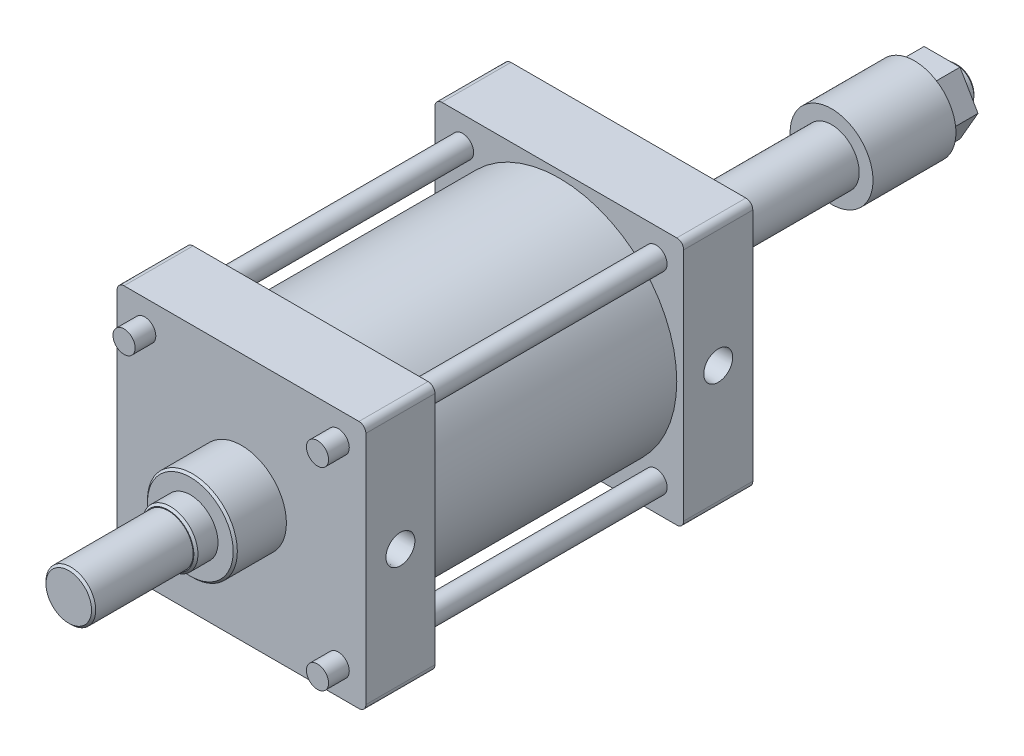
ISO-10303-21;
HEADER;
FILE_DESCRIPTION(('STEP AP214'),'2;1');
FILE_NAME('part.step','',(''),(''),'','','');
FILE_SCHEMA(('AUTOMOTIVE_DESIGN { 1 0 10303 214 1 1 1 1 }'));
ENDSEC;
DATA;
#1=APPLICATION_CONTEXT('core data for automotive mechanical design processes');
#2=APPLICATION_PROTOCOL_DEFINITION('international standard','automotive_design',2000,#1);
#3=PRODUCT_CONTEXT('',#1,'mechanical');
#4=PRODUCT('Part','Part','',(#3));
#5=PRODUCT_RELATED_PRODUCT_CATEGORY('part','',(#4));
#6=PRODUCT_DEFINITION_FORMATION('','',#4);
#7=PRODUCT_DEFINITION_CONTEXT('part definition',#1,'design');
#8=PRODUCT_DEFINITION('design','',#6,#7);
#9=PRODUCT_DEFINITION_SHAPE('','',#8);
#10=(LENGTH_UNIT() NAMED_UNIT(*) SI_UNIT(.MILLI.,.METRE.));
#11=(NAMED_UNIT(*) PLANE_ANGLE_UNIT() SI_UNIT($,.RADIAN.));
#12=(NAMED_UNIT(*) SI_UNIT($,.STERADIAN.) SOLID_ANGLE_UNIT());
#13=UNCERTAINTY_MEASURE_WITH_UNIT(LENGTH_MEASURE(1.E-05),#10,'distance_accuracy_value','');
#14=(GEOMETRIC_REPRESENTATION_CONTEXT(3) GLOBAL_UNCERTAINTY_ASSIGNED_CONTEXT((#13)) GLOBAL_UNIT_ASSIGNED_CONTEXT((#10,
#11,#12)) REPRESENTATION_CONTEXT('',''));
#15=CARTESIAN_POINT('',(0.,0.,0.));
#16=DIRECTION('',(0.,0.,1.));
#17=DIRECTION('',(1.,0.,0.));
#18=AXIS2_PLACEMENT_3D('',#15,#16,#17);
#19=CARTESIAN_POINT('',(-85.,-85.,-230.));
#20=DIRECTION('',(0.,0.,-1.));
#21=DIRECTION('',(-1.,0.,0.));
#22=AXIS2_PLACEMENT_3D('',#19,#20,#21);
#23=PLANE('',#22);
#24=CARTESIAN_POINT('',(70.0000000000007,69.9999999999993,-230.));
#25=DIRECTION('',(0.,0.,-1.));
#26=DIRECTION('',(-1.,0.,0.));
#27=AXIS2_PLACEMENT_3D('',#24,#25,#26);
#28=CIRCLE('',#27,7.99999999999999);
#29=CARTESIAN_POINT('',(62.0000000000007,69.9999999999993,-230.));
#30=VERTEX_POINT('',#29);
#31=EDGE_CURVE('E11',#30,#30,#28,.F.);
#32=ORIENTED_EDGE('',*,*,#31,.F.);
#33=EDGE_LOOP('',(#32));
#34=FACE_BOUND('',#33,.T.);
#35=ADVANCED_FACE('F44',(#34),#23,.T.);
#36=CARTESIAN_POINT('',(70.0000000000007,69.9999999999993,-252.62741699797));
#37=DIRECTION('',(0.,0.,1.));
#38=DIRECTION('',(1.,0.,0.));
#39=AXIS2_PLACEMENT_3D('',#36,#37,#38);
#40=CYLINDRICAL_SURFACE('',#39,7.99999999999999);
#41=ORIENTED_EDGE('',*,*,#31,.T.);
#42=EDGE_LOOP('',(#41));
#43=FACE_BOUND('',#42,.T.);
#44=CARTESIAN_POINT('',(70.0000000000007,69.9999999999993,65.));
#45=DIRECTION('',(0.,0.,1.));
#46=DIRECTION('',(1.,0.,0.));
#47=AXIS2_PLACEMENT_3D('',#44,#45,#46);
#48=CIRCLE('',#47,7.99999999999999);
#49=CARTESIAN_POINT('',(78.0000000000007,69.9999999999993,65.));
#50=VERTEX_POINT('',#49);
#51=EDGE_CURVE('E50',#50,#50,#48,.T.);
#52=ORIENTED_EDGE('',*,*,#51,.F.);
#53=EDGE_LOOP('',(#52));
#54=FACE_BOUND('',#53,.T.);
#55=ADVANCED_FACE('F58',(#43,#54),#40,.T.);
#56=CARTESIAN_POINT('',(70.0000000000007,69.9999999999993,65.));
#57=DIRECTION('',(0.,0.,1.));
#58=DIRECTION('',(1.,0.,0.));
#59=AXIS2_PLACEMENT_3D('',#56,#57,#58);
#60=PLANE('',#59);
#61=ORIENTED_EDGE('',*,*,#51,.T.);
#62=EDGE_LOOP('',(#61));
#63=FACE_BOUND('',#62,.T.);
#64=ADVANCED_FACE('F56',(#63),#60,.T.);
#65=CLOSED_SHELL('',(#35,#55,#64));
#66=MANIFOLD_SOLID_BREP('B2',#65);
#67=CARTESIAN_POINT('',(-85.,-85.,-230.));
#68=DIRECTION('',(0.,0.,-1.));
#69=DIRECTION('',(-1.,0.,0.));
#70=AXIS2_PLACEMENT_3D('',#67,#68,#69);
#71=PLANE('',#70);
#72=CARTESIAN_POINT('',(-69.9999999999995,70.0000000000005,-230.));
#73=DIRECTION('',(0.,0.,-1.));
#74=DIRECTION('',(-1.,0.,0.));
#75=AXIS2_PLACEMENT_3D('',#72,#73,#74);
#76=CIRCLE('',#75,7.99999999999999);
#77=CARTESIAN_POINT('',(-77.9999999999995,70.0000000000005,-230.));
#78=VERTEX_POINT('',#77);
#79=EDGE_CURVE('E43',#78,#78,#76,.F.);
#80=ORIENTED_EDGE('',*,*,#79,.F.);
#81=EDGE_LOOP('',(#80));
#82=FACE_BOUND('',#81,.T.);
#83=ADVANCED_FACE('F93',(#82),#71,.T.);
#84=CARTESIAN_POINT('',(-69.9999999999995,70.0000000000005,-252.62741699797));
#85=DIRECTION('',(0.,0.,1.));
#86=DIRECTION('',(1.,0.,0.));
#87=AXIS2_PLACEMENT_3D('',#84,#85,#86);
#88=CYLINDRICAL_SURFACE('',#87,7.99999999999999);
#89=ORIENTED_EDGE('',*,*,#79,.T.);
#90=EDGE_LOOP('',(#89));
#91=FACE_BOUND('',#90,.T.);
#92=CARTESIAN_POINT('',(-69.9999999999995,70.0000000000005,65.));
#93=DIRECTION('',(0.,0.,1.));
#94=DIRECTION('',(1.,0.,0.));
#95=AXIS2_PLACEMENT_3D('',#92,#93,#94);
#96=CIRCLE('',#95,7.99999999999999);
#97=CARTESIAN_POINT('',(-61.9999999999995,70.0000000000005,65.));
#98=VERTEX_POINT('',#97);
#99=EDGE_CURVE('E99',#98,#98,#96,.T.);
#100=ORIENTED_EDGE('',*,*,#99,.F.);
#101=EDGE_LOOP('',(#100));
#102=FACE_BOUND('',#101,.T.);
#103=ADVANCED_FACE('F107',(#91,#102),#88,.T.);
#104=CARTESIAN_POINT('',(-69.9999999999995,70.0000000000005,65.));
#105=DIRECTION('',(0.,0.,1.));
#106=DIRECTION('',(1.,0.,0.));
#107=AXIS2_PLACEMENT_3D('',#104,#105,#106);
#108=PLANE('',#107);
#109=ORIENTED_EDGE('',*,*,#99,.T.);
#110=EDGE_LOOP('',(#109));
#111=FACE_BOUND('',#110,.T.);
#112=ADVANCED_FACE('F105',(#111),#108,.T.);
#113=CLOSED_SHELL('',(#83,#103,#112));
#114=MANIFOLD_SOLID_BREP('B6',#113);
#115=CARTESIAN_POINT('',(-85.,-85.,-230.));
#116=DIRECTION('',(0.,0.,-1.));
#117=DIRECTION('',(-1.,0.,0.));
#118=AXIS2_PLACEMENT_3D('',#115,#116,#117);
#119=PLANE('',#118);
#120=CARTESIAN_POINT('',(-70.0000000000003,-69.9999999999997,-230.));
#121=DIRECTION('',(0.,0.,-1.));
#122=DIRECTION('',(-1.,0.,0.));
#123=AXIS2_PLACEMENT_3D('',#120,#121,#122);
#124=CIRCLE('',#123,8.);
#125=CARTESIAN_POINT('',(-78.0000000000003,-69.9999999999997,-230.));
#126=VERTEX_POINT('',#125);
#127=EDGE_CURVE('E92',#126,#126,#124,.F.);
#128=ORIENTED_EDGE('',*,*,#127,.F.);
#129=EDGE_LOOP('',(#128));
#130=FACE_BOUND('',#129,.T.);
#131=ADVANCED_FACE('F142',(#130),#119,.T.);
#132=CARTESIAN_POINT('',(-70.0000000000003,-69.9999999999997,-252.62741699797));
#133=DIRECTION('',(0.,0.,1.));
#134=DIRECTION('',(1.,0.,0.));
#135=AXIS2_PLACEMENT_3D('',#132,#133,#134);
#136=CYLINDRICAL_SURFACE('',#135,8.);
#137=ORIENTED_EDGE('',*,*,#127,.T.);
#138=EDGE_LOOP('',(#137));
#139=FACE_BOUND('',#138,.T.);
#140=CARTESIAN_POINT('',(-70.0000000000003,-69.9999999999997,65.));
#141=DIRECTION('',(0.,0.,1.));
#142=DIRECTION('',(1.,0.,0.));
#143=AXIS2_PLACEMENT_3D('',#140,#141,#142);
#144=CIRCLE('',#143,8.);
#145=CARTESIAN_POINT('',(-62.0000000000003,-69.9999999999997,65.));
#146=VERTEX_POINT('',#145);
#147=EDGE_CURVE('E148',#146,#146,#144,.T.);
#148=ORIENTED_EDGE('',*,*,#147,.F.);
#149=EDGE_LOOP('',(#148));
#150=FACE_BOUND('',#149,.T.);
#151=ADVANCED_FACE('F156',(#139,#150),#136,.T.);
#152=CARTESIAN_POINT('',(-70.0000000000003,-69.9999999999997,65.));
#153=DIRECTION('',(0.,0.,1.));
#154=DIRECTION('',(1.,0.,0.));
#155=AXIS2_PLACEMENT_3D('',#152,#153,#154);
#156=PLANE('',#155);
#157=ORIENTED_EDGE('',*,*,#147,.T.);
#158=EDGE_LOOP('',(#157));
#159=FACE_BOUND('',#158,.T.);
#160=ADVANCED_FACE('F154',(#159),#156,.T.);
#161=CLOSED_SHELL('',(#131,#151,#160));
#162=MANIFOLD_SOLID_BREP('B38',#161);
#163=CARTESIAN_POINT('',(-85.,-85.,-230.));
#164=DIRECTION('',(0.,0.,-1.));
#165=DIRECTION('',(-1.,0.,0.));
#166=AXIS2_PLACEMENT_3D('',#163,#164,#165);
#167=PLANE('',#166);
#168=CARTESIAN_POINT('',(70.,-70.,-230.));
#169=DIRECTION('',(0.,0.,-1.));
#170=DIRECTION('',(-1.,0.,0.));
#171=AXIS2_PLACEMENT_3D('',#168,#169,#170);
#172=CIRCLE('',#171,7.99999999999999);
#173=CARTESIAN_POINT('',(62.,-70.,-230.));
#174=VERTEX_POINT('',#173);
#175=EDGE_CURVE('E141',#174,#174,#172,.F.);
#176=ORIENTED_EDGE('',*,*,#175,.F.);
#177=EDGE_LOOP('',(#176));
#178=FACE_BOUND('',#177,.T.);
#179=ADVANCED_FACE('F192',(#178),#167,.T.);
#180=CARTESIAN_POINT('',(70.,-70.,-252.62741699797));
#181=DIRECTION('',(0.,0.,1.));
#182=DIRECTION('',(1.,0.,0.));
#183=AXIS2_PLACEMENT_3D('',#180,#181,#182);
#184=CYLINDRICAL_SURFACE('',#183,7.99999999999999);
#185=ORIENTED_EDGE('',*,*,#175,.T.);
#186=EDGE_LOOP('',(#185));
#187=FACE_BOUND('',#186,.T.);
#188=CARTESIAN_POINT('',(70.,-70.,65.));
#189=DIRECTION('',(0.,0.,1.));
#190=DIRECTION('',(1.,0.,0.));
#191=AXIS2_PLACEMENT_3D('',#188,#189,#190);
#192=CIRCLE('',#191,7.99999999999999);
#193=CARTESIAN_POINT('',(78.,-70.,65.));
#194=VERTEX_POINT('',#193);
#195=EDGE_CURVE('E198',#194,#194,#192,.T.);
#196=ORIENTED_EDGE('',*,*,#195,.F.);
#197=EDGE_LOOP('',(#196));
#198=FACE_BOUND('',#197,.T.);
#199=ADVANCED_FACE('F206',(#187,#198),#184,.T.);
#200=CARTESIAN_POINT('',(70.,-70.,65.));
#201=DIRECTION('',(0.,0.,1.));
#202=DIRECTION('',(1.,0.,0.));
#203=AXIS2_PLACEMENT_3D('',#200,#201,#202);
#204=PLANE('',#203);
#205=ORIENTED_EDGE('',*,*,#195,.T.);
#206=EDGE_LOOP('',(#205));
#207=FACE_BOUND('',#206,.T.);
#208=ADVANCED_FACE('F204',(#207),#204,.T.);
#209=CLOSED_SHELL('',(#179,#199,#208));
#210=MANIFOLD_SOLID_BREP('B87',#209);
#211=CARTESIAN_POINT('',(0.,0.,-437.));
#212=DIRECTION('',(0.,0.,-1.));
#213=DIRECTION('',(-1.,0.,0.));
#214=AXIS2_PLACEMENT_3D('',#211,#212,#213);
#215=PLANE('',#214);
#216=CARTESIAN_POINT('',(0.,0.,-437.));
#217=DIRECTION('',(0.,0.,-1.));
#218=DIRECTION('',(-1.,0.,0.));
#219=AXIS2_PLACEMENT_3D('',#216,#217,#218);
#220=CIRCLE('',#219,30.);
#221=CARTESIAN_POINT('',(-30.,0.,-437.));
#222=VERTEX_POINT('',#221);
#223=EDGE_CURVE('E955',#222,#222,#220,.T.);
#224=ORIENTED_EDGE('',*,*,#223,.T.);
#225=EDGE_LOOP('',(#224));
#226=FACE_BOUND('',#225,.T.);
#227=DIRECTION('',(-0.5,-0.866025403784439,0.));
#228=VECTOR('',#227,1.);
#229=CARTESIAN_POINT('',(25.9807621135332,0.,-437.));
#230=LINE('',#229,#228);
#231=CARTESIAN_POINT('',(25.9807621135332,0.,-437.));
#232=VERTEX_POINT('',#231);
#233=CARTESIAN_POINT('',(12.9903810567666,-22.5,-437.));
#234=VERTEX_POINT('',#233);
#235=EDGE_CURVE('E931',#232,#234,#230,.T.);
#236=ORIENTED_EDGE('',*,*,#235,.F.);
#237=DIRECTION('',(0.5,-0.866025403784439,0.));
#238=VECTOR('',#237,1.);
#239=CARTESIAN_POINT('',(12.9903810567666,22.5,-437.));
#240=LINE('',#239,#238);
#241=CARTESIAN_POINT('',(12.9903810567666,22.5,-437.));
#242=VERTEX_POINT('',#241);
#243=EDGE_CURVE('E913',#242,#232,#240,.T.);
#244=ORIENTED_EDGE('',*,*,#243,.F.);
#245=DIRECTION('',(1.,0.,0.));
#246=VECTOR('',#245,1.);
#247=CARTESIAN_POINT('',(-12.9903810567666,22.5,-437.));
#248=LINE('',#247,#246);
#249=CARTESIAN_POINT('',(-12.9903810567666,22.5,-437.));
#250=VERTEX_POINT('',#249);
#251=EDGE_CURVE('E918',#250,#242,#248,.T.);
#252=ORIENTED_EDGE('',*,*,#251,.F.);
#253=DIRECTION('',(0.5,0.866025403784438,0.));
#254=VECTOR('',#253,1.);
#255=CARTESIAN_POINT('',(-25.9807621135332,0.,-437.));
#256=LINE('',#255,#254);
#257=CARTESIAN_POINT('',(-25.9807621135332,0.,-437.));
#258=VERTEX_POINT('',#257);
#259=EDGE_CURVE('E937',#258,#250,#256,.T.);
#260=ORIENTED_EDGE('',*,*,#259,.F.);
#261=DIRECTION('',(-0.5,0.866025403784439,0.));
#262=VECTOR('',#261,1.);
#263=CARTESIAN_POINT('',(-12.9903810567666,-22.5,-437.));
#264=LINE('',#263,#262);
#265=CARTESIAN_POINT('',(-12.9903810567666,-22.5,-437.));
#266=VERTEX_POINT('',#265);
#267=EDGE_CURVE('E935',#266,#258,#264,.T.);
#268=ORIENTED_EDGE('',*,*,#267,.F.);
#269=DIRECTION('',(-1.,0.,0.));
#270=VECTOR('',#269,1.);
#271=CARTESIAN_POINT('',(12.9903810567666,-22.5,-437.));
#272=LINE('',#271,#270);
#273=EDGE_CURVE('E933',#234,#266,#272,.T.);
#274=ORIENTED_EDGE('',*,*,#273,.F.);
#275=EDGE_LOOP('',(#236,#244,#252,#260,#268,#274));
#276=FACE_BOUND('',#275,.T.);
#277=ADVANCED_FACE('F233',(#226,#276),#215,.T.);
#278=CARTESIAN_POINT('',(-85.,-85.,50.));
#279=DIRECTION('',(0.,0.,1.));
#280=DIRECTION('',(1.,0.,0.));
#281=AXIS2_PLACEMENT_3D('',#278,#279,#280);
#282=PLANE('',#281);
#283=CARTESIAN_POINT('',(0.,0.,50.));
#284=DIRECTION('',(0.,0.,1.));
#285=DIRECTION('',(1.,0.,0.));
#286=AXIS2_PLACEMENT_3D('',#283,#284,#285);
#287=CIRCLE('',#286,32.5);
#288=CARTESIAN_POINT('',(32.5,0.,50.));
#289=VERTEX_POINT('',#288);
#290=EDGE_CURVE('E619',#289,#289,#287,.T.);
#291=ORIENTED_EDGE('',*,*,#290,.F.);
#292=EDGE_LOOP('',(#291));
#293=FACE_BOUND('',#292,.T.);
#294=CARTESIAN_POINT('',(-69.9999999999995,70.0000000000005,50.));
#295=DIRECTION('',(0.,0.,1.));
#296=DIRECTION('',(1.,0.,0.));
#297=AXIS2_PLACEMENT_3D('',#294,#295,#296);
#298=CIRCLE('',#297,7.99999999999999);
#299=CARTESIAN_POINT('',(-61.9999999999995,70.0000000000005,50.));
#300=VERTEX_POINT('',#299);
#301=EDGE_CURVE('E729',#300,#300,#298,.T.);
#302=ORIENTED_EDGE('',*,*,#301,.F.);
#303=EDGE_LOOP('',(#302));
#304=FACE_BOUND('',#303,.T.);
#305=CARTESIAN_POINT('',(70.,-70.,50.));
#306=DIRECTION('',(0.,0.,1.));
#307=DIRECTION('',(1.,0.,0.));
#308=AXIS2_PLACEMENT_3D('',#305,#306,#307);
#309=CIRCLE('',#308,7.99999999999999);
#310=CARTESIAN_POINT('',(78.,-70.,50.));
#311=VERTEX_POINT('',#310);
#312=EDGE_CURVE('E348',#311,#311,#309,.T.);
#313=ORIENTED_EDGE('',*,*,#312,.F.);
#314=EDGE_LOOP('',(#313));
#315=FACE_BOUND('',#314,.T.);
#316=CARTESIAN_POINT('',(-85.,-85.,50.));
#317=DIRECTION('',(0.,0.,1.));
#318=DIRECTION('',(1.,0.,0.));
#319=AXIS2_PLACEMENT_3D('',#316,#317,#318);
#320=CIRCLE('',#319,5.);
#321=CARTESIAN_POINT('',(-90.,-85.,50.));
#322=VERTEX_POINT('',#321);
#323=CARTESIAN_POINT('',(-85.,-90.,50.));
#324=VERTEX_POINT('',#323);
#325=EDGE_CURVE('E360',#322,#324,#320,.T.);
#326=ORIENTED_EDGE('',*,*,#325,.T.);
#327=DIRECTION('',(1.,0.,0.));
#328=VECTOR('',#327,1.);
#329=CARTESIAN_POINT('',(85.,-90.,50.));
#330=LINE('',#329,#328);
#331=CARTESIAN_POINT('',(85.,-90.,50.));
#332=VERTEX_POINT('',#331);
#333=EDGE_CURVE('E299',#324,#332,#330,.T.);
#334=ORIENTED_EDGE('',*,*,#333,.T.);
#335=CARTESIAN_POINT('',(85.,-85.,50.));
#336=DIRECTION('',(0.,0.,1.));
#337=DIRECTION('',(-1.,0.,0.));
#338=AXIS2_PLACEMENT_3D('',#335,#336,#337);
#339=CIRCLE('',#338,5.);
#340=CARTESIAN_POINT('',(90.,-84.9999999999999,50.));
#341=VERTEX_POINT('',#340);
#342=EDGE_CURVE('E747',#332,#341,#339,.T.);
#343=ORIENTED_EDGE('',*,*,#342,.T.);
#344=DIRECTION('',(0.,1.,0.));
#345=VECTOR('',#344,1.);
#346=CARTESIAN_POINT('',(90.,85.,50.));
#347=LINE('',#346,#345);
#348=CARTESIAN_POINT('',(90.,85.,50.));
#349=VERTEX_POINT('',#348);
#350=EDGE_CURVE('E749',#341,#349,#347,.T.);
#351=ORIENTED_EDGE('',*,*,#350,.T.);
#352=CARTESIAN_POINT('',(85.,85.,50.));
#353=DIRECTION('',(0.,0.,1.));
#354=DIRECTION('',(-1.,0.,0.));
#355=AXIS2_PLACEMENT_3D('',#352,#353,#354);
#356=CIRCLE('',#355,5.);
#357=CARTESIAN_POINT('',(85.,90.0000000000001,50.));
#358=VERTEX_POINT('',#357);
#359=EDGE_CURVE('E323',#349,#358,#356,.T.);
#360=ORIENTED_EDGE('',*,*,#359,.T.);
#361=DIRECTION('',(-1.,0.,0.));
#362=VECTOR('',#361,1.);
#363=CARTESIAN_POINT('',(85.,90.0000000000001,50.));
#364=LINE('',#363,#362);
#365=CARTESIAN_POINT('',(-85.,90.,50.));
#366=VERTEX_POINT('',#365);
#367=EDGE_CURVE('E315',#358,#366,#364,.T.);
#368=ORIENTED_EDGE('',*,*,#367,.T.);
#369=CARTESIAN_POINT('',(-85.,85.,50.));
#370=DIRECTION('',(0.,0.,1.));
#371=DIRECTION('',(1.,0.,0.));
#372=AXIS2_PLACEMENT_3D('',#369,#370,#371);
#373=CIRCLE('',#372,5.);
#374=CARTESIAN_POINT('',(-90.,85.,50.));
#375=VERTEX_POINT('',#374);
#376=EDGE_CURVE('E320',#366,#375,#373,.T.);
#377=ORIENTED_EDGE('',*,*,#376,.T.);
#378=DIRECTION('',(0.,-1.,0.));
#379=VECTOR('',#378,1.);
#380=CARTESIAN_POINT('',(-90.,85.,50.));
#381=LINE('',#380,#379);
#382=EDGE_CURVE('E257',#375,#322,#381,.T.);
#383=ORIENTED_EDGE('',*,*,#382,.T.);
#384=EDGE_LOOP('',(#326,#334,#343,#351,#360,#368,#377,#383));
#385=FACE_BOUND('',#384,.T.);
#386=CARTESIAN_POINT('',(-70.0000000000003,-69.9999999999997,50.));
#387=DIRECTION('',(0.,0.,1.));
#388=DIRECTION('',(1.,0.,0.));
#389=AXIS2_PLACEMENT_3D('',#386,#387,#388);
#390=CIRCLE('',#389,8.);
#391=CARTESIAN_POINT('',(-62.0000000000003,-69.9999999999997,50.));
#392=VERTEX_POINT('',#391);
#393=EDGE_CURVE('E735',#392,#392,#390,.T.);
#394=ORIENTED_EDGE('',*,*,#393,.F.);
#395=EDGE_LOOP('',(#394));
#396=FACE_BOUND('',#395,.T.);
#397=CARTESIAN_POINT('',(70.0000000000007,69.9999999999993,50.));
#398=DIRECTION('',(0.,0.,1.));
#399=DIRECTION('',(1.,0.,0.));
#400=AXIS2_PLACEMENT_3D('',#397,#398,#399);
#401=CIRCLE('',#400,8.);
#402=CARTESIAN_POINT('',(78.0000000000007,69.9999999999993,50.));
#403=VERTEX_POINT('',#402);
#404=EDGE_CURVE('E723',#403,#403,#401,.T.);
#405=ORIENTED_EDGE('',*,*,#404,.F.);
#406=EDGE_LOOP('',(#405));
#407=FACE_BOUND('',#406,.T.);
#408=ADVANCED_FACE('F317',(#293,#304,#315,#385,#396,#407),#282,.T.);
#409=CARTESIAN_POINT('',(-85.,-85.,0.));
#410=DIRECTION('',(0.,0.,1.));
#411=DIRECTION('',(1.,0.,0.));
#412=AXIS2_PLACEMENT_3D('',#409,#410,#411);
#413=PLANE('',#412);
#414=CARTESIAN_POINT('',(0.,0.,0.));
#415=DIRECTION('',(0.,0.,1.));
#416=DIRECTION('',(1.,0.,0.));
#417=AXIS2_PLACEMENT_3D('',#414,#415,#416);
#418=CIRCLE('',#417,85.);
#419=CARTESIAN_POINT('',(85.,0.,0.));
#420=VERTEX_POINT('',#419);
#421=EDGE_CURVE('E375',#420,#420,#418,.F.);
#422=ORIENTED_EDGE('',*,*,#421,.F.);
#423=EDGE_LOOP('',(#422));
#424=FACE_BOUND('',#423,.T.);
#425=CARTESIAN_POINT('',(-85.,-85.,0.));
#426=DIRECTION('',(0.,0.,1.));
#427=DIRECTION('',(1.,0.,0.));
#428=AXIS2_PLACEMENT_3D('',#425,#426,#427);
#429=CIRCLE('',#428,5.);
#430=CARTESIAN_POINT('',(-90.,-85.,0.));
#431=VERTEX_POINT('',#430);
#432=CARTESIAN_POINT('',(-85.,-90.,0.));
#433=VERTEX_POINT('',#432);
#434=EDGE_CURVE('E344',#431,#433,#429,.T.);
#435=ORIENTED_EDGE('',*,*,#434,.F.);
#436=DIRECTION('',(0.,-1.,0.));
#437=VECTOR('',#436,1.);
#438=CARTESIAN_POINT('',(-90.,85.,0.));
#439=LINE('',#438,#437);
#440=CARTESIAN_POINT('',(-90.,85.,0.));
#441=VERTEX_POINT('',#440);
#442=EDGE_CURVE('E290',#441,#431,#439,.T.);
#443=ORIENTED_EDGE('',*,*,#442,.F.);
#444=CARTESIAN_POINT('',(-85.,85.,0.));
#445=DIRECTION('',(0.,0.,1.));
#446=DIRECTION('',(1.,0.,0.));
#447=AXIS2_PLACEMENT_3D('',#444,#445,#446);
#448=CIRCLE('',#447,5.);
#449=CARTESIAN_POINT('',(-85.,90.,0.));
#450=VERTEX_POINT('',#449);
#451=EDGE_CURVE('E357',#450,#441,#448,.T.);
#452=ORIENTED_EDGE('',*,*,#451,.F.);
#453=DIRECTION('',(-1.,0.,0.));
#454=VECTOR('',#453,1.);
#455=CARTESIAN_POINT('',(85.,90.0000000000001,0.));
#456=LINE('',#455,#454);
#457=CARTESIAN_POINT('',(85.,90.0000000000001,0.));
#458=VERTEX_POINT('',#457);
#459=EDGE_CURVE('E332',#458,#450,#456,.T.);
#460=ORIENTED_EDGE('',*,*,#459,.F.);
#461=CARTESIAN_POINT('',(85.,85.,0.));
#462=DIRECTION('',(0.,0.,1.));
#463=DIRECTION('',(-1.,0.,0.));
#464=AXIS2_PLACEMENT_3D('',#461,#462,#463);
#465=CIRCLE('',#464,5.);
#466=CARTESIAN_POINT('',(90.,85.,0.));
#467=VERTEX_POINT('',#466);
#468=EDGE_CURVE('E354',#467,#458,#465,.T.);
#469=ORIENTED_EDGE('',*,*,#468,.F.);
#470=DIRECTION('',(0.,1.,0.));
#471=VECTOR('',#470,1.);
#472=CARTESIAN_POINT('',(90.,85.,0.));
#473=LINE('',#472,#471);
#474=CARTESIAN_POINT('',(90.,-84.9999999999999,0.));
#475=VERTEX_POINT('',#474);
#476=EDGE_CURVE('E352',#475,#467,#473,.T.);
#477=ORIENTED_EDGE('',*,*,#476,.F.);
#478=CARTESIAN_POINT('',(85.,-85.,0.));
#479=DIRECTION('',(0.,0.,1.));
#480=DIRECTION('',(-1.,0.,0.));
#481=AXIS2_PLACEMENT_3D('',#478,#479,#480);
#482=CIRCLE('',#481,5.);
#483=CARTESIAN_POINT('',(85.,-90.,0.));
#484=VERTEX_POINT('',#483);
#485=EDGE_CURVE('E350',#484,#475,#482,.T.);
#486=ORIENTED_EDGE('',*,*,#485,.F.);
#487=DIRECTION('',(1.,0.,0.));
#488=VECTOR('',#487,1.);
#489=CARTESIAN_POINT('',(85.,-90.,0.));
#490=LINE('',#489,#488);
#491=EDGE_CURVE('E347',#433,#484,#490,.T.);
#492=ORIENTED_EDGE('',*,*,#491,.F.);
#493=EDGE_LOOP('',(#435,#443,#452,#460,#469,#477,#486,#492));
#494=FACE_BOUND('',#493,.T.);
#495=CARTESIAN_POINT('',(70.,-70.,0.));
#496=DIRECTION('',(0.,0.,1.));
#497=DIRECTION('',(1.,0.,0.));
#498=AXIS2_PLACEMENT_3D('',#495,#496,#497);
#499=CIRCLE('',#498,7.99999999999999);
#500=CARTESIAN_POINT('',(78.,-70.,0.));
#501=VERTEX_POINT('',#500);
#502=EDGE_CURVE('E738',#501,#501,#499,.T.);
#503=ORIENTED_EDGE('',*,*,#502,.T.);
#504=EDGE_LOOP('',(#503));
#505=FACE_BOUND('',#504,.T.);
#506=CARTESIAN_POINT('',(-70.0000000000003,-69.9999999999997,0.));
#507=DIRECTION('',(0.,0.,1.));
#508=DIRECTION('',(1.,0.,0.));
#509=AXIS2_PLACEMENT_3D('',#506,#507,#508);
#510=CIRCLE('',#509,8.);
#511=CARTESIAN_POINT('',(-62.0000000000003,-69.9999999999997,0.));
#512=VERTEX_POINT('',#511);
#513=EDGE_CURVE('E732',#512,#512,#510,.T.);
#514=ORIENTED_EDGE('',*,*,#513,.T.);
#515=EDGE_LOOP('',(#514));
#516=FACE_BOUND('',#515,.T.);
#517=CARTESIAN_POINT('',(-69.9999999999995,70.0000000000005,0.));
#518=DIRECTION('',(0.,0.,1.));
#519=DIRECTION('',(1.,0.,0.));
#520=AXIS2_PLACEMENT_3D('',#517,#518,#519);
#521=CIRCLE('',#520,7.99999999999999);
#522=CARTESIAN_POINT('',(-61.9999999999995,70.0000000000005,0.));
#523=VERTEX_POINT('',#522);
#524=EDGE_CURVE('E726',#523,#523,#521,.T.);
#525=ORIENTED_EDGE('',*,*,#524,.T.);
#526=EDGE_LOOP('',(#525));
#527=FACE_BOUND('',#526,.T.);
#528=CARTESIAN_POINT('',(70.0000000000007,69.9999999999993,0.));
#529=DIRECTION('',(0.,0.,1.));
#530=DIRECTION('',(1.,0.,0.));
#531=AXIS2_PLACEMENT_3D('',#528,#529,#530);
#532=CIRCLE('',#531,8.);
#533=CARTESIAN_POINT('',(78.0000000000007,69.9999999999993,0.));
#534=VERTEX_POINT('',#533);
#535=EDGE_CURVE('E722',#534,#534,#532,.T.);
#536=ORIENTED_EDGE('',*,*,#535,.T.);
#537=EDGE_LOOP('',(#536));
#538=FACE_BOUND('',#537,.T.);
#539=ADVANCED_FACE('F421',(#424,#494,#505,#516,#527,#538),#413,.F.);
#540=CARTESIAN_POINT('',(-85.,-85.,50.));
#541=DIRECTION('',(0.,0.,-1.));
#542=DIRECTION('',(-1.,0.,0.));
#543=AXIS2_PLACEMENT_3D('',#540,#541,#542);
#544=CYLINDRICAL_SURFACE('',#543,5.);
#545=ORIENTED_EDGE('',*,*,#434,.T.);
#546=DIRECTION('',(0.,0.,-1.));
#547=VECTOR('',#546,1.);
#548=CARTESIAN_POINT('',(-85.,-90.,50.));
#549=LINE('',#548,#547);
#550=EDGE_CURVE('E373',#324,#433,#549,.T.);
#551=ORIENTED_EDGE('',*,*,#550,.F.);
#552=ORIENTED_EDGE('',*,*,#325,.F.);
#553=DIRECTION('',(0.,0.,-1.));
#554=VECTOR('',#553,1.);
#555=CARTESIAN_POINT('',(-90.,-85.,50.));
#556=LINE('',#555,#554);
#557=EDGE_CURVE('E340',#322,#431,#556,.T.);
#558=ORIENTED_EDGE('',*,*,#557,.T.);
#559=EDGE_LOOP('',(#545,#551,#552,#558));
#560=FACE_BOUND('',#559,.T.);
#561=ADVANCED_FACE('F563',(#560),#544,.T.);
#562=CARTESIAN_POINT('',(85.,-90.,50.));
#563=DIRECTION('',(0.,1.,0.));
#564=DIRECTION('',(-1.,0.,0.));
#565=AXIS2_PLACEMENT_3D('',#562,#563,#564);
#566=PLANE('',#565);
#567=ORIENTED_EDGE('',*,*,#491,.T.);
#568=DIRECTION('',(0.,0.,-1.));
#569=VECTOR('',#568,1.);
#570=CARTESIAN_POINT('',(85.,-90.,50.));
#571=LINE('',#570,#569);
#572=EDGE_CURVE('E370',#332,#484,#571,.T.);
#573=ORIENTED_EDGE('',*,*,#572,.F.);
#574=ORIENTED_EDGE('',*,*,#333,.F.);
#575=ORIENTED_EDGE('',*,*,#550,.T.);
#576=EDGE_LOOP('',(#567,#573,#574,#575));
#577=FACE_BOUND('',#576,.T.);
#578=ADVANCED_FACE('F582',(#577),#566,.F.);
#579=CARTESIAN_POINT('',(85.,-85.,50.));
#580=DIRECTION('',(0.,0.,-1.));
#581=DIRECTION('',(-1.,0.,0.));
#582=AXIS2_PLACEMENT_3D('',#579,#580,#581);
#583=CYLINDRICAL_SURFACE('',#582,5.);
#584=ORIENTED_EDGE('',*,*,#485,.T.);
#585=DIRECTION('',(0.,0.,-1.));
#586=VECTOR('',#585,1.);
#587=CARTESIAN_POINT('',(90.,-84.9999999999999,50.));
#588=LINE('',#587,#586);
#589=EDGE_CURVE('E367',#341,#475,#588,.T.);
#590=ORIENTED_EDGE('',*,*,#589,.F.);
#591=ORIENTED_EDGE('',*,*,#342,.F.);
#592=ORIENTED_EDGE('',*,*,#572,.T.);
#593=EDGE_LOOP('',(#584,#590,#591,#592));
#594=FACE_BOUND('',#593,.T.);
#595=ADVANCED_FACE('F578',(#594),#583,.T.);
#596=CARTESIAN_POINT('',(90.,85.,50.));
#597=DIRECTION('',(-1.,0.,0.));
#598=DIRECTION('',(0.,-1.,0.));
#599=AXIS2_PLACEMENT_3D('',#596,#597,#598);
#600=PLANE('',#599);
#601=CARTESIAN_POINT('',(90.,0.,25.));
#602=DIRECTION('',(1.,0.,0.));
#603=DIRECTION('',(0.,0.,-1.));
#604=AXIS2_PLACEMENT_3D('',#601,#602,#603);
#605=CIRCLE('',#604,10.4775);
#606=CARTESIAN_POINT('',(90.,0.,14.5225));
#607=VERTEX_POINT('',#606);
#608=EDGE_CURVE('E1423',#607,#607,#605,.T.);
#609=ORIENTED_EDGE('',*,*,#608,.F.);
#610=EDGE_LOOP('',(#609));
#611=FACE_BOUND('',#610,.T.);
#612=ORIENTED_EDGE('',*,*,#476,.T.);
#613=DIRECTION('',(0.,0.,-1.));
#614=VECTOR('',#613,1.);
#615=CARTESIAN_POINT('',(90.,85.,50.));
#616=LINE('',#615,#614);
#617=EDGE_CURVE('E364',#349,#467,#616,.T.);
#618=ORIENTED_EDGE('',*,*,#617,.F.);
#619=ORIENTED_EDGE('',*,*,#350,.F.);
#620=ORIENTED_EDGE('',*,*,#589,.T.);
#621=EDGE_LOOP('',(#612,#618,#619,#620));
#622=FACE_BOUND('',#621,.T.);
#623=ADVANCED_FACE('F574',(#611,#622),#600,.F.);
#624=CARTESIAN_POINT('',(85.,85.,50.));
#625=DIRECTION('',(0.,0.,-1.));
#626=DIRECTION('',(-1.,0.,0.));
#627=AXIS2_PLACEMENT_3D('',#624,#625,#626);
#628=CYLINDRICAL_SURFACE('',#627,5.);
#629=ORIENTED_EDGE('',*,*,#468,.T.);
#630=DIRECTION('',(0.,0.,-1.));
#631=VECTOR('',#630,1.);
#632=CARTESIAN_POINT('',(85.,90.0000000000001,50.));
#633=LINE('',#632,#631);
#634=EDGE_CURVE('E335',#358,#458,#633,.T.);
#635=ORIENTED_EDGE('',*,*,#634,.F.);
#636=ORIENTED_EDGE('',*,*,#359,.F.);
#637=ORIENTED_EDGE('',*,*,#617,.T.);
#638=EDGE_LOOP('',(#629,#635,#636,#637));
#639=FACE_BOUND('',#638,.T.);
#640=ADVANCED_FACE('F571',(#639),#628,.T.);
#641=CARTESIAN_POINT('',(85.,90.0000000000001,50.));
#642=DIRECTION('',(0.,-1.,0.));
#643=DIRECTION('',(1.,0.,0.));
#644=AXIS2_PLACEMENT_3D('',#641,#642,#643);
#645=PLANE('',#644);
#646=ORIENTED_EDGE('',*,*,#459,.T.);
#647=DIRECTION('',(0.,0.,-1.));
#648=VECTOR('',#647,1.);
#649=CARTESIAN_POINT('',(-85.,90.,50.));
#650=LINE('',#649,#648);
#651=EDGE_CURVE('E329',#366,#450,#650,.T.);
#652=ORIENTED_EDGE('',*,*,#651,.F.);
#653=ORIENTED_EDGE('',*,*,#367,.F.);
#654=ORIENTED_EDGE('',*,*,#634,.T.);
#655=EDGE_LOOP('',(#646,#652,#653,#654));
#656=FACE_BOUND('',#655,.T.);
#657=ADVANCED_FACE('F330',(#656),#645,.F.);
#658=CARTESIAN_POINT('',(-85.,85.,50.));
#659=DIRECTION('',(0.,0.,-1.));
#660=DIRECTION('',(-1.,0.,0.));
#661=AXIS2_PLACEMENT_3D('',#658,#659,#660);
#662=CYLINDRICAL_SURFACE('',#661,5.);
#663=ORIENTED_EDGE('',*,*,#451,.T.);
#664=DIRECTION('',(0.,0.,-1.));
#665=VECTOR('',#664,1.);
#666=CARTESIAN_POINT('',(-90.,85.,50.));
#667=LINE('',#666,#665);
#668=EDGE_CURVE('E336',#375,#441,#667,.T.);
#669=ORIENTED_EDGE('',*,*,#668,.F.);
#670=ORIENTED_EDGE('',*,*,#376,.F.);
#671=ORIENTED_EDGE('',*,*,#651,.T.);
#672=EDGE_LOOP('',(#663,#669,#670,#671));
#673=FACE_BOUND('',#672,.T.);
#674=ADVANCED_FACE('F338',(#673),#662,.T.);
#675=CARTESIAN_POINT('',(-90.,85.,50.));
#676=DIRECTION('',(1.,0.,0.));
#677=DIRECTION('',(0.,1.,0.));
#678=AXIS2_PLACEMENT_3D('',#675,#676,#677);
#679=PLANE('',#678);
#680=ORIENTED_EDGE('',*,*,#442,.T.);
#681=ORIENTED_EDGE('',*,*,#557,.F.);
#682=ORIENTED_EDGE('',*,*,#382,.F.);
#683=ORIENTED_EDGE('',*,*,#668,.T.);
#684=EDGE_LOOP('',(#680,#681,#682,#683));
#685=FACE_BOUND('',#684,.T.);
#686=ADVANCED_FACE('F558',(#685),#679,.F.);
#687=CARTESIAN_POINT('',(70.,-70.,50.));
#688=DIRECTION('',(0.,0.,-1.));
#689=DIRECTION('',(-1.,0.,0.));
#690=AXIS2_PLACEMENT_3D('',#687,#688,#689);
#691=CYLINDRICAL_SURFACE('',#690,7.99999999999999);
#692=ORIENTED_EDGE('',*,*,#312,.T.);
#693=EDGE_LOOP('',(#692));
#694=FACE_BOUND('',#693,.T.);
#695=ORIENTED_EDGE('',*,*,#502,.F.);
#696=EDGE_LOOP('',(#695));
#697=FACE_BOUND('',#696,.T.);
#698=ADVANCED_FACE('F555',(#694,#697),#691,.F.);
#699=CARTESIAN_POINT('',(-70.0000000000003,-69.9999999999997,50.));
#700=DIRECTION('',(0.,0.,-1.));
#701=DIRECTION('',(-1.,0.,0.));
#702=AXIS2_PLACEMENT_3D('',#699,#700,#701);
#703=CYLINDRICAL_SURFACE('',#702,8.);
#704=ORIENTED_EDGE('',*,*,#393,.T.);
#705=EDGE_LOOP('',(#704));
#706=FACE_BOUND('',#705,.T.);
#707=ORIENTED_EDGE('',*,*,#513,.F.);
#708=EDGE_LOOP('',(#707));
#709=FACE_BOUND('',#708,.T.);
#710=ADVANCED_FACE('F551',(#706,#709),#703,.F.);
#711=CARTESIAN_POINT('',(-69.9999999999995,70.0000000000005,50.));
#712=DIRECTION('',(0.,0.,-1.));
#713=DIRECTION('',(-1.,0.,0.));
#714=AXIS2_PLACEMENT_3D('',#711,#712,#713);
#715=CYLINDRICAL_SURFACE('',#714,7.99999999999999);
#716=ORIENTED_EDGE('',*,*,#301,.T.);
#717=EDGE_LOOP('',(#716));
#718=FACE_BOUND('',#717,.T.);
#719=ORIENTED_EDGE('',*,*,#524,.F.);
#720=EDGE_LOOP('',(#719));
#721=FACE_BOUND('',#720,.T.);
#722=ADVANCED_FACE('F547',(#718,#721),#715,.F.);
#723=CARTESIAN_POINT('',(70.0000000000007,69.9999999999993,50.));
#724=DIRECTION('',(0.,0.,-1.));
#725=DIRECTION('',(-1.,0.,0.));
#726=AXIS2_PLACEMENT_3D('',#723,#724,#725);
#727=CYLINDRICAL_SURFACE('',#726,8.);
#728=ORIENTED_EDGE('',*,*,#404,.T.);
#729=EDGE_LOOP('',(#728));
#730=FACE_BOUND('',#729,.T.);
#731=ORIENTED_EDGE('',*,*,#535,.F.);
#732=EDGE_LOOP('',(#731));
#733=FACE_BOUND('',#732,.T.);
#734=ADVANCED_FACE('F543',(#730,#733),#727,.F.);
#735=CARTESIAN_POINT('',(0.,0.,-180.));
#736=DIRECTION('',(0.,0.,1.));
#737=DIRECTION('',(1.,0.,0.));
#738=AXIS2_PLACEMENT_3D('',#735,#736,#737);
#739=CYLINDRICAL_SURFACE('',#738,85.);
#740=CARTESIAN_POINT('',(0.,0.,-180.));
#741=DIRECTION('',(0.,0.,-1.));
#742=DIRECTION('',(-1.,0.,0.));
#743=AXIS2_PLACEMENT_3D('',#740,#741,#742);
#744=CIRCLE('',#743,85.);
#745=CARTESIAN_POINT('',(85.,0.,-180.));
#746=VERTEX_POINT('',#745);
#747=EDGE_CURVE('E719',#746,#746,#744,.T.);
#748=CARTESIAN_POINT('',(85.,0.,-180.));
#749=CARTESIAN_POINT('',(85.,0.,-178.125));
#750=CARTESIAN_POINT('',(85.,0.,-176.25));
#751=CARTESIAN_POINT('',(85.,0.,-172.5));
#752=CARTESIAN_POINT('',(85.,0.,-170.625));
#753=CARTESIAN_POINT('',(85.,0.,-166.875));
#754=CARTESIAN_POINT('',(85.,0.,-165.));
#755=CARTESIAN_POINT('',(85.,0.,-161.25));
#756=CARTESIAN_POINT('',(85.,0.,-159.375));
#757=CARTESIAN_POINT('',(85.,0.,-155.625));
#758=CARTESIAN_POINT('',(85.,0.,-153.75));
#759=CARTESIAN_POINT('',(85.,0.,-150.));
#760=CARTESIAN_POINT('',(85.,0.,-148.125));
#761=CARTESIAN_POINT('',(85.,0.,-144.375));
#762=CARTESIAN_POINT('',(85.,0.,-142.5));
#763=CARTESIAN_POINT('',(85.,0.,-138.75));
#764=CARTESIAN_POINT('',(85.,0.,-136.875));
#765=CARTESIAN_POINT('',(85.,0.,-133.125));
#766=CARTESIAN_POINT('',(85.,0.,-131.25));
#767=CARTESIAN_POINT('',(85.,0.,-127.5));
#768=CARTESIAN_POINT('',(85.,0.,-125.625));
#769=CARTESIAN_POINT('',(85.,0.,-121.875));
#770=CARTESIAN_POINT('',(85.,0.,-120.));
#771=CARTESIAN_POINT('',(85.,0.,-116.25));
#772=CARTESIAN_POINT('',(85.,0.,-114.375));
#773=CARTESIAN_POINT('',(85.,0.,-110.625));
#774=CARTESIAN_POINT('',(85.,0.,-108.75));
#775=CARTESIAN_POINT('',(85.,0.,-105.));
#776=CARTESIAN_POINT('',(85.,0.,-103.125));
#777=CARTESIAN_POINT('',(85.,0.,-99.375));
#778=CARTESIAN_POINT('',(85.,0.,-97.5));
#779=CARTESIAN_POINT('',(85.,0.,-93.75));
#780=CARTESIAN_POINT('',(85.,0.,-91.875));
#781=CARTESIAN_POINT('',(85.,0.,-88.125));
#782=CARTESIAN_POINT('',(85.,0.,-86.25));
#783=CARTESIAN_POINT('',(85.,0.,-82.5));
#784=CARTESIAN_POINT('',(85.,0.,-80.625));
#785=CARTESIAN_POINT('',(85.,0.,-76.875));
#786=CARTESIAN_POINT('',(85.,0.,-75.));
#787=CARTESIAN_POINT('',(85.,0.,-71.25));
#788=CARTESIAN_POINT('',(85.,0.,-69.375));
#789=CARTESIAN_POINT('',(85.,0.,-65.625));
#790=CARTESIAN_POINT('',(85.,0.,-63.75));
#791=CARTESIAN_POINT('',(85.,0.,-60.));
#792=CARTESIAN_POINT('',(85.,0.,-58.125));
#793=CARTESIAN_POINT('',(85.,0.,-54.375));
#794=CARTESIAN_POINT('',(85.,0.,-52.5));
#795=CARTESIAN_POINT('',(85.,0.,-48.75));
#796=CARTESIAN_POINT('',(85.,0.,-46.875));
#797=CARTESIAN_POINT('',(85.,0.,-43.125));
#798=CARTESIAN_POINT('',(85.,0.,-41.25));
#799=CARTESIAN_POINT('',(85.,0.,-37.5));
#800=CARTESIAN_POINT('',(85.,0.,-35.625));
#801=CARTESIAN_POINT('',(85.,0.,-31.875));
#802=CARTESIAN_POINT('',(85.,0.,-30.));
#803=CARTESIAN_POINT('',(85.,0.,-26.25));
#804=CARTESIAN_POINT('',(85.,0.,-24.375));
#805=CARTESIAN_POINT('',(85.,0.,-20.625));
#806=CARTESIAN_POINT('',(85.,0.,-18.75));
#807=CARTESIAN_POINT('',(85.,0.,-15.));
#808=CARTESIAN_POINT('',(85.,0.,-13.125));
#809=CARTESIAN_POINT('',(85.,0.,-9.37500000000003));
#810=CARTESIAN_POINT('',(85.,0.,-7.50000000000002));
#811=CARTESIAN_POINT('',(85.,0.,-3.75000000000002));
#812=CARTESIAN_POINT('',(85.,0.,-1.87500000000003));
#813=CARTESIAN_POINT('',(85.,0.,0.));
#814=B_SPLINE_CURVE_WITH_KNOTS('',3,(#748,#749,#750,#751,#752,#753,#754,#755,#756,#757,#758,
#759,#760,#761,#762,#763,#764,#765,#766,#767,#768,#769,#770,#771,#772,#773,#774,#775,#776,#777,
#778,#779,#780,#781,#782,#783,#784,#785,#786,#787,#788,#789,#790,#791,#792,#793,#794,#795,#796,
#797,#798,#799,#800,#801,#802,#803,#804,#805,#806,#807,#808,#809,#810,#811,#812,#813),
.UNSPECIFIED.,.F.,.F.,(4,2,2,2,2,2,2,2,2,2,2,2,2,2,2,2,2,2,2,2,2,2,2,2,2,2,2,2,2,2,2,2,4),(0.,
5.62499999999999,11.25,16.875,22.5,28.125,33.75,39.375,45.,50.625,56.25,61.875,67.5,73.125,
78.75,84.3749999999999,90.,95.625,101.25,106.875,112.5,118.125,123.75,129.375,135.,140.625,
146.25,151.875,157.5,163.125,168.75,174.375,180.),.UNSPECIFIED.);
#815=EDGE_CURVE('BSEAM505',#746,#420,#814,.T.);
#816=ORIENTED_EDGE('',*,*,#747,.F.);
#817=ORIENTED_EDGE('',*,*,#421,.T.);
#818=ORIENTED_EDGE('',*,*,#815,.T.);
#819=ORIENTED_EDGE('',*,*,#815,.F.);
#820=EDGE_LOOP('',(#816,#818,#817,#819));
#821=FACE_BOUND('',#820,.T.);
#822=ADVANCED_FACE('F505',(#821),#739,.T.);
#823=CARTESIAN_POINT('',(-85.,-85.,-230.));
#824=DIRECTION('',(0.,0.,-1.));
#825=DIRECTION('',(-1.,0.,0.));
#826=AXIS2_PLACEMENT_3D('',#823,#824,#825);
#827=PLANE('',#826);
#828=CARTESIAN_POINT('',(0.,0.,-230.));
#829=DIRECTION('',(0.,0.,-1.));
#830=DIRECTION('',(-1.,0.,0.));
#831=AXIS2_PLACEMENT_3D('',#828,#829,#830);
#832=CIRCLE('',#831,32.5);
#833=CARTESIAN_POINT('',(-32.5,0.,-230.));
#834=VERTEX_POINT('',#833);
#835=EDGE_CURVE('E607',#834,#834,#832,.T.);
#836=ORIENTED_EDGE('',*,*,#835,.F.);
#837=EDGE_LOOP('',(#836));
#838=FACE_BOUND('',#837,.T.);
#839=CARTESIAN_POINT('',(-69.9999999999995,70.0000000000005,-230.));
#840=DIRECTION('',(0.,0.,-1.));
#841=DIRECTION('',(-1.,0.,0.));
#842=AXIS2_PLACEMENT_3D('',#839,#840,#841);
#843=CIRCLE('',#842,7.99999999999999);
#844=CARTESIAN_POINT('',(-77.9999999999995,70.0000000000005,-230.));
#845=VERTEX_POINT('',#844);
#846=EDGE_CURVE('E630',#845,#845,#843,.T.);
#847=ORIENTED_EDGE('',*,*,#846,.F.);
#848=EDGE_LOOP('',(#847));
#849=FACE_BOUND('',#848,.T.);
#850=CARTESIAN_POINT('',(-70.0000000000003,-69.9999999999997,-230.));
#851=DIRECTION('',(0.,0.,-1.));
#852=DIRECTION('',(-1.,0.,0.));
#853=AXIS2_PLACEMENT_3D('',#850,#851,#852);
#854=CIRCLE('',#853,8.);
#855=CARTESIAN_POINT('',(-78.0000000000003,-69.9999999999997,-230.));
#856=VERTEX_POINT('',#855);
#857=EDGE_CURVE('E642',#856,#856,#854,.T.);
#858=ORIENTED_EDGE('',*,*,#857,.F.);
#859=EDGE_LOOP('',(#858));
#860=FACE_BOUND('',#859,.T.);
#861=CARTESIAN_POINT('',(-85.,-85.,-230.));
#862=DIRECTION('',(0.,0.,-1.));
#863=DIRECTION('',(-1.,0.,0.));
#864=AXIS2_PLACEMENT_3D('',#861,#862,#863);
#865=CIRCLE('',#864,5.);
#866=CARTESIAN_POINT('',(-85.,-90.,-230.));
#867=VERTEX_POINT('',#866);
#868=CARTESIAN_POINT('',(-90.,-85.,-230.));
#869=VERTEX_POINT('',#868);
#870=EDGE_CURVE('E648',#867,#869,#865,.T.);
#871=ORIENTED_EDGE('',*,*,#870,.T.);
#872=DIRECTION('',(0.,1.,0.));
#873=VECTOR('',#872,1.);
#874=CARTESIAN_POINT('',(-90.,-85.,-230.));
#875=LINE('',#874,#873);
#876=CARTESIAN_POINT('',(-90.,85.,-230.));
#877=VERTEX_POINT('',#876);
#878=EDGE_CURVE('E651',#869,#877,#875,.T.);
#879=ORIENTED_EDGE('',*,*,#878,.T.);
#880=CARTESIAN_POINT('',(-85.,85.,-230.));
#881=DIRECTION('',(0.,0.,-1.));
#882=DIRECTION('',(-1.,0.,0.));
#883=AXIS2_PLACEMENT_3D('',#880,#881,#882);
#884=CIRCLE('',#883,5.);
#885=CARTESIAN_POINT('',(-85.,90.,-230.));
#886=VERTEX_POINT('',#885);
#887=EDGE_CURVE('E655',#877,#886,#884,.T.);
#888=ORIENTED_EDGE('',*,*,#887,.T.);
#889=DIRECTION('',(1.,0.,0.));
#890=VECTOR('',#889,1.);
#891=CARTESIAN_POINT('',(-85.,90.,-230.));
#892=LINE('',#891,#890);
#893=CARTESIAN_POINT('',(85.,90.0000000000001,-230.));
#894=VERTEX_POINT('',#893);
#895=EDGE_CURVE('E658',#886,#894,#892,.T.);
#896=ORIENTED_EDGE('',*,*,#895,.T.);
#897=CARTESIAN_POINT('',(85.,85.,-230.));
#898=DIRECTION('',(0.,0.,-1.));
#899=DIRECTION('',(-1.,0.,0.));
#900=AXIS2_PLACEMENT_3D('',#897,#898,#899);
#901=CIRCLE('',#900,5.);
#902=CARTESIAN_POINT('',(90.,85.,-230.));
#903=VERTEX_POINT('',#902);
#904=EDGE_CURVE('E661',#894,#903,#901,.T.);
#905=ORIENTED_EDGE('',*,*,#904,.T.);
#906=DIRECTION('',(0.,-1.,0.));
#907=VECTOR('',#906,1.);
#908=CARTESIAN_POINT('',(90.,85.,-230.));
#909=LINE('',#908,#907);
#910=CARTESIAN_POINT('',(90.,-84.9999999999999,-230.));
#911=VERTEX_POINT('',#910);
#912=EDGE_CURVE('E664',#903,#911,#909,.T.);
#913=ORIENTED_EDGE('',*,*,#912,.T.);
#914=CARTESIAN_POINT('',(85.,-85.,-230.));
#915=DIRECTION('',(0.,0.,-1.));
#916=DIRECTION('',(-1.,0.,0.));
#917=AXIS2_PLACEMENT_3D('',#914,#915,#916);
#918=CIRCLE('',#917,5.);
#919=CARTESIAN_POINT('',(85.,-90.,-230.));
#920=VERTEX_POINT('',#919);
#921=EDGE_CURVE('E667',#911,#920,#918,.T.);
#922=ORIENTED_EDGE('',*,*,#921,.T.);
#923=DIRECTION('',(-1.,0.,0.));
#924=VECTOR('',#923,1.);
#925=CARTESIAN_POINT('',(85.,-90.,-230.));
#926=LINE('',#925,#924);
#927=EDGE_CURVE('E670',#920,#867,#926,.T.);
#928=ORIENTED_EDGE('',*,*,#927,.T.);
#929=EDGE_LOOP('',(#871,#879,#888,#896,#905,#913,#922,#928));
#930=FACE_BOUND('',#929,.T.);
#931=CARTESIAN_POINT('',(70.,-70.,-230.));
#932=DIRECTION('',(0.,0.,-1.));
#933=DIRECTION('',(-1.,0.,0.));
#934=AXIS2_PLACEMENT_3D('',#931,#932,#933);
#935=CIRCLE('',#934,7.99999999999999);
#936=CARTESIAN_POINT('',(62.,-70.,-230.));
#937=VERTEX_POINT('',#936);
#938=EDGE_CURVE('E636',#937,#937,#935,.T.);
#939=ORIENTED_EDGE('',*,*,#938,.F.);
#940=EDGE_LOOP('',(#939));
#941=FACE_BOUND('',#940,.T.);
#942=CARTESIAN_POINT('',(70.0000000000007,69.9999999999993,-230.));
#943=DIRECTION('',(0.,0.,-1.));
#944=DIRECTION('',(-1.,0.,0.));
#945=AXIS2_PLACEMENT_3D('',#942,#943,#944);
#946=CIRCLE('',#945,7.99999999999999);
#947=CARTESIAN_POINT('',(62.0000000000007,69.9999999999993,-230.));
#948=VERTEX_POINT('',#947);
#949=EDGE_CURVE('E624',#948,#948,#946,.T.);
#950=ORIENTED_EDGE('',*,*,#949,.F.);
#951=EDGE_LOOP('',(#950));
#952=FACE_BOUND('',#951,.T.);
#953=ADVANCED_FACE('F501',(#838,#849,#860,#930,#941,#952),#827,.T.);
#954=CARTESIAN_POINT('',(-85.,-85.,-180.));
#955=DIRECTION('',(0.,0.,-1.));
#956=DIRECTION('',(-1.,0.,0.));
#957=AXIS2_PLACEMENT_3D('',#954,#955,#956);
#958=PLANE('',#957);
#959=ORIENTED_EDGE('',*,*,#747,.T.);
#960=EDGE_LOOP('',(#959));
#961=FACE_BOUND('',#960,.T.);
#962=CARTESIAN_POINT('',(-85.,-85.,-180.));
#963=DIRECTION('',(0.,0.,-1.));
#964=DIRECTION('',(-1.,0.,0.));
#965=AXIS2_PLACEMENT_3D('',#962,#963,#964);
#966=CIRCLE('',#965,5.);
#967=CARTESIAN_POINT('',(-85.,-90.,-180.));
#968=VERTEX_POINT('',#967);
#969=CARTESIAN_POINT('',(-90.,-85.,-180.));
#970=VERTEX_POINT('',#969);
#971=EDGE_CURVE('E645',#968,#970,#966,.T.);
#972=ORIENTED_EDGE('',*,*,#971,.F.);
#973=DIRECTION('',(-1.,0.,0.));
#974=VECTOR('',#973,1.);
#975=CARTESIAN_POINT('',(85.,-90.,-180.));
#976=LINE('',#975,#974);
#977=CARTESIAN_POINT('',(85.,-90.,-180.));
#978=VERTEX_POINT('',#977);
#979=EDGE_CURVE('E652',#978,#968,#976,.T.);
#980=ORIENTED_EDGE('',*,*,#979,.F.);
#981=CARTESIAN_POINT('',(85.,-85.,-180.));
#982=DIRECTION('',(0.,0.,-1.));
#983=DIRECTION('',(-1.,0.,0.));
#984=AXIS2_PLACEMENT_3D('',#981,#982,#983);
#985=CIRCLE('',#984,5.);
#986=CARTESIAN_POINT('',(90.,-84.9999999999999,-180.));
#987=VERTEX_POINT('',#986);
#988=EDGE_CURVE('E691',#987,#978,#985,.T.);
#989=ORIENTED_EDGE('',*,*,#988,.F.);
#990=DIRECTION('',(0.,-1.,0.));
#991=VECTOR('',#990,1.);
#992=CARTESIAN_POINT('',(90.,85.,-180.));
#993=LINE('',#992,#991);
#994=CARTESIAN_POINT('',(90.,85.,-180.));
#995=VERTEX_POINT('',#994);
#996=EDGE_CURVE('E688',#995,#987,#993,.T.);
#997=ORIENTED_EDGE('',*,*,#996,.F.);
#998=CARTESIAN_POINT('',(85.,85.,-180.));
#999=DIRECTION('',(0.,0.,-1.));
#1000=DIRECTION('',(-1.,0.,0.));
#1001=AXIS2_PLACEMENT_3D('',#998,#999,#1000);
#1002=CIRCLE('',#1001,5.);
#1003=CARTESIAN_POINT('',(85.,90.0000000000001,-180.));
#1004=VERTEX_POINT('',#1003);
#1005=EDGE_CURVE('E685',#1004,#995,#1002,.T.);
#1006=ORIENTED_EDGE('',*,*,#1005,.F.);
#1007=DIRECTION('',(1.,0.,0.));
#1008=VECTOR('',#1007,1.);
#1009=CARTESIAN_POINT('',(-85.,90.,-180.));
#1010=LINE('',#1009,#1008);
#1011=CARTESIAN_POINT('',(-85.,90.,-180.));
#1012=VERTEX_POINT('',#1011);
#1013=EDGE_CURVE('E682',#1012,#1004,#1010,.T.);
#1014=ORIENTED_EDGE('',*,*,#1013,.F.);
#1015=CARTESIAN_POINT('',(-85.,85.,-180.));
#1016=DIRECTION('',(0.,0.,-1.));
#1017=DIRECTION('',(-1.,0.,0.));
#1018=AXIS2_PLACEMENT_3D('',#1015,#1016,#1017);
#1019=CIRCLE('',#1018,5.);
#1020=CARTESIAN_POINT('',(-90.,85.,-180.));
#1021=VERTEX_POINT('',#1020);
#1022=EDGE_CURVE('E679',#1021,#1012,#1019,.T.);
#1023=ORIENTED_EDGE('',*,*,#1022,.F.);
#1024=DIRECTION('',(0.,1.,0.));
#1025=VECTOR('',#1024,1.);
#1026=CARTESIAN_POINT('',(-90.,-85.,-180.));
#1027=LINE('',#1026,#1025);
#1028=EDGE_CURVE('E676',#970,#1021,#1027,.T.);
#1029=ORIENTED_EDGE('',*,*,#1028,.F.);
#1030=EDGE_LOOP('',(#972,#980,#989,#997,#1006,#1014,#1023,#1029));
#1031=FACE_BOUND('',#1030,.T.);
#1032=CARTESIAN_POINT('',(-70.0000000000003,-69.9999999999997,-180.));
#1033=DIRECTION('',(0.,0.,-1.));
#1034=DIRECTION('',(-1.,0.,0.));
#1035=AXIS2_PLACEMENT_3D('',#1032,#1033,#1034);
#1036=CIRCLE('',#1035,8.);
#1037=CARTESIAN_POINT('',(-78.0000000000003,-69.9999999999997,-180.));
#1038=VERTEX_POINT('',#1037);
#1039=EDGE_CURVE('E639',#1038,#1038,#1036,.T.);
#1040=ORIENTED_EDGE('',*,*,#1039,.T.);
#1041=EDGE_LOOP('',(#1040));
#1042=FACE_BOUND('',#1041,.T.);
#1043=CARTESIAN_POINT('',(70.,-70.,-180.));
#1044=DIRECTION('',(0.,0.,-1.));
#1045=DIRECTION('',(-1.,0.,0.));
#1046=AXIS2_PLACEMENT_3D('',#1043,#1044,#1045);
#1047=CIRCLE('',#1046,7.99999999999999);
#1048=CARTESIAN_POINT('',(62.,-70.,-180.));
#1049=VERTEX_POINT('',#1048);
#1050=EDGE_CURVE('E633',#1049,#1049,#1047,.T.);
#1051=ORIENTED_EDGE('',*,*,#1050,.T.);
#1052=EDGE_LOOP('',(#1051));
#1053=FACE_BOUND('',#1052,.T.);
#1054=CARTESIAN_POINT('',(-69.9999999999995,70.0000000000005,-180.));
#1055=DIRECTION('',(0.,0.,-1.));
#1056=DIRECTION('',(-1.,0.,0.));
#1057=AXIS2_PLACEMENT_3D('',#1054,#1055,#1056);
#1058=CIRCLE('',#1057,7.99999999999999);
#1059=CARTESIAN_POINT('',(-77.9999999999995,70.0000000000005,-180.));
#1060=VERTEX_POINT('',#1059);
#1061=EDGE_CURVE('E627',#1060,#1060,#1058,.T.);
#1062=ORIENTED_EDGE('',*,*,#1061,.T.);
#1063=EDGE_LOOP('',(#1062));
#1064=FACE_BOUND('',#1063,.T.);
#1065=CARTESIAN_POINT('',(70.0000000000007,69.9999999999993,-180.));
#1066=DIRECTION('',(0.,0.,-1.));
#1067=DIRECTION('',(-1.,0.,0.));
#1068=AXIS2_PLACEMENT_3D('',#1065,#1066,#1067);
#1069=CIRCLE('',#1068,7.99999999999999);
#1070=CARTESIAN_POINT('',(62.0000000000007,69.9999999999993,-180.));
#1071=VERTEX_POINT('',#1070);
#1072=EDGE_CURVE('E623',#1071,#1071,#1069,.T.);
#1073=ORIENTED_EDGE('',*,*,#1072,.T.);
#1074=EDGE_LOOP('',(#1073));
#1075=FACE_BOUND('',#1074,.T.);
#1076=ADVANCED_FACE('F504',(#961,#1031,#1042,#1053,#1064,#1075),#958,.F.);
#1077=CARTESIAN_POINT('',(-85.,-85.,-230.));
#1078=DIRECTION('',(0.,0.,1.));
#1079=DIRECTION('',(1.,0.,0.));
#1080=AXIS2_PLACEMENT_3D('',#1077,#1078,#1079);
#1081=CYLINDRICAL_SURFACE('',#1080,5.);
#1082=ORIENTED_EDGE('',*,*,#971,.T.);
#1083=DIRECTION('',(0.,0.,1.));
#1084=VECTOR('',#1083,1.);
#1085=CARTESIAN_POINT('',(-90.,-85.,-230.));
#1086=LINE('',#1085,#1084);
#1087=EDGE_CURVE('E716',#869,#970,#1086,.T.);
#1088=ORIENTED_EDGE('',*,*,#1087,.F.);
#1089=ORIENTED_EDGE('',*,*,#870,.F.);
#1090=DIRECTION('',(0.,0.,1.));
#1091=VECTOR('',#1090,1.);
#1092=CARTESIAN_POINT('',(-85.,-90.,-230.));
#1093=LINE('',#1092,#1091);
#1094=EDGE_CURVE('E673',#867,#968,#1093,.T.);
#1095=ORIENTED_EDGE('',*,*,#1094,.T.);
#1096=EDGE_LOOP('',(#1082,#1088,#1089,#1095));
#1097=FACE_BOUND('',#1096,.T.);
#1098=ADVANCED_FACE('F509',(#1097),#1081,.T.);
#1099=CARTESIAN_POINT('',(-90.,-85.,-230.));
#1100=DIRECTION('',(1.,0.,0.));
#1101=DIRECTION('',(0.,1.,0.));
#1102=AXIS2_PLACEMENT_3D('',#1099,#1100,#1101);
#1103=PLANE('',#1102);
#1104=ORIENTED_EDGE('',*,*,#1028,.T.);
#1105=DIRECTION('',(0.,0.,1.));
#1106=VECTOR('',#1105,1.);
#1107=CARTESIAN_POINT('',(-90.,85.,-230.));
#1108=LINE('',#1107,#1106);
#1109=EDGE_CURVE('E713',#877,#1021,#1108,.T.);
#1110=ORIENTED_EDGE('',*,*,#1109,.F.);
#1111=ORIENTED_EDGE('',*,*,#878,.F.);
#1112=ORIENTED_EDGE('',*,*,#1087,.T.);
#1113=EDGE_LOOP('',(#1104,#1110,#1111,#1112));
#1114=FACE_BOUND('',#1113,.T.);
#1115=ADVANCED_FACE('F533',(#1114),#1103,.F.);
#1116=CARTESIAN_POINT('',(-85.,85.,-230.));
#1117=DIRECTION('',(0.,0.,1.));
#1118=DIRECTION('',(1.,0.,0.));
#1119=AXIS2_PLACEMENT_3D('',#1116,#1117,#1118);
#1120=CYLINDRICAL_SURFACE('',#1119,5.);
#1121=ORIENTED_EDGE('',*,*,#1022,.T.);
#1122=DIRECTION('',(0.,0.,1.));
#1123=VECTOR('',#1122,1.);
#1124=CARTESIAN_POINT('',(-85.,90.,-230.));
#1125=LINE('',#1124,#1123);
#1126=EDGE_CURVE('E710',#886,#1012,#1125,.T.);
#1127=ORIENTED_EDGE('',*,*,#1126,.F.);
#1128=ORIENTED_EDGE('',*,*,#887,.F.);
#1129=ORIENTED_EDGE('',*,*,#1109,.T.);
#1130=EDGE_LOOP('',(#1121,#1127,#1128,#1129));
#1131=FACE_BOUND('',#1130,.T.);
#1132=ADVANCED_FACE('F529',(#1131),#1120,.T.);
#1133=CARTESIAN_POINT('',(-85.,90.,-230.));
#1134=DIRECTION('',(0.,-1.,0.));
#1135=DIRECTION('',(1.,0.,0.));
#1136=AXIS2_PLACEMENT_3D('',#1133,#1134,#1135);
#1137=PLANE('',#1136);
#1138=ORIENTED_EDGE('',*,*,#1013,.T.);
#1139=DIRECTION('',(0.,0.,1.));
#1140=VECTOR('',#1139,1.);
#1141=CARTESIAN_POINT('',(85.,90.0000000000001,-230.));
#1142=LINE('',#1141,#1140);
#1143=EDGE_CURVE('E707',#894,#1004,#1142,.T.);
#1144=ORIENTED_EDGE('',*,*,#1143,.F.);
#1145=ORIENTED_EDGE('',*,*,#895,.F.);
#1146=ORIENTED_EDGE('',*,*,#1126,.T.);
#1147=EDGE_LOOP('',(#1138,#1144,#1145,#1146));
#1148=FACE_BOUND('',#1147,.T.);
#1149=ADVANCED_FACE('F525',(#1148),#1137,.F.);
#1150=CARTESIAN_POINT('',(85.,85.,-230.));
#1151=DIRECTION('',(0.,0.,1.));
#1152=DIRECTION('',(1.,0.,0.));
#1153=AXIS2_PLACEMENT_3D('',#1150,#1151,#1152);
#1154=CYLINDRICAL_SURFACE('',#1153,5.);
#1155=ORIENTED_EDGE('',*,*,#1005,.T.);
#1156=DIRECTION('',(0.,0.,1.));
#1157=VECTOR('',#1156,1.);
#1158=CARTESIAN_POINT('',(90.,85.,-230.));
#1159=LINE('',#1158,#1157);
#1160=EDGE_CURVE('E704',#903,#995,#1159,.T.);
#1161=ORIENTED_EDGE('',*,*,#1160,.F.);
#1162=ORIENTED_EDGE('',*,*,#904,.F.);
#1163=ORIENTED_EDGE('',*,*,#1143,.T.);
#1164=EDGE_LOOP('',(#1155,#1161,#1162,#1163));
#1165=FACE_BOUND('',#1164,.T.);
#1166=ADVANCED_FACE('F521',(#1165),#1154,.T.);
#1167=CARTESIAN_POINT('',(90.,85.,-230.));
#1168=DIRECTION('',(-1.,0.,0.));
#1169=DIRECTION('',(0.,-1.,0.));
#1170=AXIS2_PLACEMENT_3D('',#1167,#1168,#1169);
#1171=PLANE('',#1170);
#1172=CARTESIAN_POINT('',(90.,0.,-205.));
#1173=DIRECTION('',(1.,0.,0.));
#1174=DIRECTION('',(0.,0.,-1.));
#1175=AXIS2_PLACEMENT_3D('',#1172,#1173,#1174);
#1176=CIRCLE('',#1175,10.4775);
#1177=CARTESIAN_POINT('',(90.,0.,-215.4775));
#1178=VERTEX_POINT('',#1177);
#1179=EDGE_CURVE('E891',#1178,#1178,#1176,.T.);
#1180=ORIENTED_EDGE('',*,*,#1179,.F.);
#1181=EDGE_LOOP('',(#1180));
#1182=FACE_BOUND('',#1181,.T.);
#1183=ORIENTED_EDGE('',*,*,#996,.T.);
#1184=DIRECTION('',(0.,0.,1.));
#1185=VECTOR('',#1184,1.);
#1186=CARTESIAN_POINT('',(90.,-84.9999999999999,-230.));
#1187=LINE('',#1186,#1185);
#1188=EDGE_CURVE('E701',#911,#987,#1187,.T.);
#1189=ORIENTED_EDGE('',*,*,#1188,.F.);
#1190=ORIENTED_EDGE('',*,*,#912,.F.);
#1191=ORIENTED_EDGE('',*,*,#1160,.T.);
#1192=EDGE_LOOP('',(#1183,#1189,#1190,#1191));
#1193=FACE_BOUND('',#1192,.T.);
#1194=ADVANCED_FACE('F517',(#1182,#1193),#1171,.F.);
#1195=CARTESIAN_POINT('',(85.,-85.,-230.));
#1196=DIRECTION('',(0.,0.,1.));
#1197=DIRECTION('',(1.,0.,0.));
#1198=AXIS2_PLACEMENT_3D('',#1195,#1196,#1197);
#1199=CYLINDRICAL_SURFACE('',#1198,5.);
#1200=ORIENTED_EDGE('',*,*,#988,.T.);
#1201=DIRECTION('',(0.,0.,1.));
#1202=VECTOR('',#1201,1.);
#1203=CARTESIAN_POINT('',(85.,-90.,-230.));
#1204=LINE('',#1203,#1202);
#1205=EDGE_CURVE('E698',#920,#978,#1204,.T.);
#1206=ORIENTED_EDGE('',*,*,#1205,.F.);
#1207=ORIENTED_EDGE('',*,*,#921,.F.);
#1208=ORIENTED_EDGE('',*,*,#1188,.T.);
#1209=EDGE_LOOP('',(#1200,#1206,#1207,#1208));
#1210=FACE_BOUND('',#1209,.T.);
#1211=ADVANCED_FACE('F513',(#1210),#1199,.T.);
#1212=CARTESIAN_POINT('',(85.,-90.,-230.));
#1213=DIRECTION('',(0.,1.,0.));
#1214=DIRECTION('',(-1.,0.,0.));
#1215=AXIS2_PLACEMENT_3D('',#1212,#1213,#1214);
#1216=PLANE('',#1215);
#1217=ORIENTED_EDGE('',*,*,#979,.T.);
#1218=ORIENTED_EDGE('',*,*,#1094,.F.);
#1219=ORIENTED_EDGE('',*,*,#927,.F.);
#1220=ORIENTED_EDGE('',*,*,#1205,.T.);
#1221=EDGE_LOOP('',(#1217,#1218,#1219,#1220));
#1222=FACE_BOUND('',#1221,.T.);
#1223=ADVANCED_FACE('F499',(#1222),#1216,.F.);
#1224=CARTESIAN_POINT('',(-70.0000000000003,-69.9999999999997,-230.));
#1225=DIRECTION('',(0.,0.,1.));
#1226=DIRECTION('',(1.,0.,0.));
#1227=AXIS2_PLACEMENT_3D('',#1224,#1225,#1226);
#1228=CYLINDRICAL_SURFACE('',#1227,8.);
#1229=ORIENTED_EDGE('',*,*,#857,.T.);
#1230=EDGE_LOOP('',(#1229));
#1231=FACE_BOUND('',#1230,.T.);
#1232=ORIENTED_EDGE('',*,*,#1039,.F.);
#1233=EDGE_LOOP('',(#1232));
#1234=FACE_BOUND('',#1233,.T.);
#1235=ADVANCED_FACE('F495',(#1231,#1234),#1228,.F.);
#1236=CARTESIAN_POINT('',(70.,-70.,-230.));
#1237=DIRECTION('',(0.,0.,1.));
#1238=DIRECTION('',(1.,0.,0.));
#1239=AXIS2_PLACEMENT_3D('',#1236,#1237,#1238);
#1240=CYLINDRICAL_SURFACE('',#1239,7.99999999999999);
#1241=ORIENTED_EDGE('',*,*,#938,.T.);
#1242=EDGE_LOOP('',(#1241));
#1243=FACE_BOUND('',#1242,.T.);
#1244=ORIENTED_EDGE('',*,*,#1050,.F.);
#1245=EDGE_LOOP('',(#1244));
#1246=FACE_BOUND('',#1245,.T.);
#1247=ADVANCED_FACE('F491',(#1243,#1246),#1240,.F.);
#1248=CARTESIAN_POINT('',(-69.9999999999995,70.0000000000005,-230.));
#1249=DIRECTION('',(0.,0.,1.));
#1250=DIRECTION('',(1.,0.,0.));
#1251=AXIS2_PLACEMENT_3D('',#1248,#1249,#1250);
#1252=CYLINDRICAL_SURFACE('',#1251,7.99999999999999);
#1253=ORIENTED_EDGE('',*,*,#846,.T.);
#1254=EDGE_LOOP('',(#1253));
#1255=FACE_BOUND('',#1254,.T.);
#1256=ORIENTED_EDGE('',*,*,#1061,.F.);
#1257=EDGE_LOOP('',(#1256));
#1258=FACE_BOUND('',#1257,.T.);
#1259=ADVANCED_FACE('F487',(#1255,#1258),#1252,.F.);
#1260=CARTESIAN_POINT('',(70.0000000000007,69.9999999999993,-230.));
#1261=DIRECTION('',(0.,0.,1.));
#1262=DIRECTION('',(1.,0.,0.));
#1263=AXIS2_PLACEMENT_3D('',#1260,#1261,#1262);
#1264=CYLINDRICAL_SURFACE('',#1263,7.99999999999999);
#1265=ORIENTED_EDGE('',*,*,#949,.T.);
#1266=EDGE_LOOP('',(#1265));
#1267=FACE_BOUND('',#1266,.T.);
#1268=ORIENTED_EDGE('',*,*,#1072,.F.);
#1269=EDGE_LOOP('',(#1268));
#1270=FACE_BOUND('',#1269,.T.);
#1271=ADVANCED_FACE('F483',(#1267,#1270),#1264,.F.);
#1272=CARTESIAN_POINT('',(0.,0.,87.));
#1273=DIRECTION('',(0.,0.,-1.));
#1274=DIRECTION('',(-1.,0.,0.));
#1275=AXIS2_PLACEMENT_3D('',#1272,#1273,#1274);
#1276=CYLINDRICAL_SURFACE('',#1275,32.5);
#1277=CARTESIAN_POINT('',(0.,0.,85.5000000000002));
#1278=DIRECTION('',(0.,0.,1.));
#1279=DIRECTION('',(1.,0.,0.));
#1280=AXIS2_PLACEMENT_3D('',#1277,#1278,#1279);
#1281=CIRCLE('',#1280,32.5);
#1282=CARTESIAN_POINT('',(32.5,0.,85.5000000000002));
#1283=VERTEX_POINT('',#1282);
#1284=EDGE_CURVE('E393',#1283,#1283,#1281,.F.);
#1285=ORIENTED_EDGE('',*,*,#1284,.T.);
#1286=EDGE_LOOP('',(#1285));
#1287=FACE_BOUND('',#1286,.T.);
#1288=ORIENTED_EDGE('',*,*,#290,.T.);
#1289=EDGE_LOOP('',(#1288));
#1290=FACE_BOUND('',#1289,.T.);
#1291=ADVANCED_FACE('F479',(#1287,#1290),#1276,.T.);
#1292=CARTESIAN_POINT('',(0.,0.,87.));
#1293=DIRECTION('',(0.,0.,1.));
#1294=DIRECTION('',(1.,0.,0.));
#1295=AXIS2_PLACEMENT_3D('',#1292,#1293,#1294);
#1296=PLANE('',#1295);
#1297=CARTESIAN_POINT('',(0.,0.,87.));
#1298=DIRECTION('',(0.,0.,1.));
#1299=DIRECTION('',(1.,0.,0.));
#1300=AXIS2_PLACEMENT_3D('',#1297,#1298,#1299);
#1301=CIRCLE('',#1300,31.0000000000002);
#1302=CARTESIAN_POINT('',(31.0000000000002,0.,87.));
#1303=VERTEX_POINT('',#1302);
#1304=EDGE_CURVE('E390',#1303,#1303,#1301,.T.);
#1305=ORIENTED_EDGE('',*,*,#1304,.T.);
#1306=EDGE_LOOP('',(#1305));
#1307=FACE_BOUND('',#1306,.T.);
#1308=CARTESIAN_POINT('',(0.,0.,87.));
#1309=DIRECTION('',(0.,0.,1.));
#1310=DIRECTION('',(1.,0.,0.));
#1311=AXIS2_PLACEMENT_3D('',#1308,#1309,#1310);
#1312=CIRCLE('',#1311,20.);
#1313=CARTESIAN_POINT('',(20.,0.,87.));
#1314=VERTEX_POINT('',#1313);
#1315=EDGE_CURVE('E605',#1314,#1314,#1312,.T.);
#1316=ORIENTED_EDGE('',*,*,#1315,.F.);
#1317=EDGE_LOOP('',(#1316));
#1318=FACE_BOUND('',#1317,.T.);
#1319=ADVANCED_FACE('F475',(#1307,#1318),#1296,.T.);
#1320=CARTESIAN_POINT('',(0.,0.,-267.));
#1321=DIRECTION('',(0.,0.,1.));
#1322=DIRECTION('',(1.,0.,0.));
#1323=AXIS2_PLACEMENT_3D('',#1320,#1321,#1322);
#1324=CYLINDRICAL_SURFACE('',#1323,32.5);
#1325=CARTESIAN_POINT('',(0.,0.,-267.));
#1326=DIRECTION('',(0.,0.,-1.));
#1327=DIRECTION('',(-1.,0.,0.));
#1328=AXIS2_PLACEMENT_3D('',#1325,#1326,#1327);
#1329=CIRCLE('',#1328,32.5);
#1330=CARTESIAN_POINT('',(-32.5,0.,-267.));
#1331=VERTEX_POINT('',#1330);
#1332=EDGE_CURVE('E611',#1331,#1331,#1329,.T.);
#1333=ORIENTED_EDGE('',*,*,#1332,.F.);
#1334=EDGE_LOOP('',(#1333));
#1335=FACE_BOUND('',#1334,.T.);
#1336=ORIENTED_EDGE('',*,*,#835,.T.);
#1337=EDGE_LOOP('',(#1336));
#1338=FACE_BOUND('',#1337,.T.);
#1339=ADVANCED_FACE('F471',(#1335,#1338),#1324,.T.);
#1340=CARTESIAN_POINT('',(0.,0.,-267.));
#1341=DIRECTION('',(0.,0.,-1.));
#1342=DIRECTION('',(-1.,0.,0.));
#1343=AXIS2_PLACEMENT_3D('',#1340,#1341,#1342);
#1344=PLANE('',#1343);
#1345=CARTESIAN_POINT('',(0.,0.,-267.));
#1346=DIRECTION('',(0.,0.,-1.));
#1347=DIRECTION('',(-1.,0.,0.));
#1348=AXIS2_PLACEMENT_3D('',#1345,#1346,#1347);
#1349=CIRCLE('',#1348,30.);
#1350=CARTESIAN_POINT('',(-30.,0.,-267.));
#1351=VERTEX_POINT('',#1350);
#1352=EDGE_CURVE('E963',#1351,#1351,#1349,.T.);
#1353=ORIENTED_EDGE('',*,*,#1352,.F.);
#1354=EDGE_LOOP('',(#1353));
#1355=FACE_BOUND('',#1354,.T.);
#1356=ORIENTED_EDGE('',*,*,#1332,.T.);
#1357=EDGE_LOOP('',(#1356));
#1358=FACE_BOUND('',#1357,.T.);
#1359=ADVANCED_FACE('F467',(#1355,#1358),#1344,.T.);
#1360=CARTESIAN_POINT('',(0.,0.,103.));
#1361=DIRECTION('',(0.,0.,-1.));
#1362=DIRECTION('',(-1.,0.,0.));
#1363=AXIS2_PLACEMENT_3D('',#1360,#1361,#1362);
#1364=CYLINDRICAL_SURFACE('',#1363,20.);
#1365=CARTESIAN_POINT('',(0.,0.,101.5));
#1366=DIRECTION('',(0.,0.,1.));
#1367=DIRECTION('',(1.,0.,0.));
#1368=AXIS2_PLACEMENT_3D('',#1365,#1366,#1367);
#1369=CIRCLE('',#1368,20.);
#1370=CARTESIAN_POINT('',(-20.,0.,101.5));
#1371=VERTEX_POINT('',#1370);
#1372=EDGE_CURVE('E387',#1371,#1371,#1369,.F.);
#1373=ORIENTED_EDGE('',*,*,#1372,.T.);
#1374=EDGE_LOOP('',(#1373));
#1375=FACE_BOUND('',#1374,.T.);
#1376=ORIENTED_EDGE('',*,*,#1315,.T.);
#1377=EDGE_LOOP('',(#1376));
#1378=FACE_BOUND('',#1377,.T.);
#1379=ADVANCED_FACE('F463',(#1375,#1378),#1364,.T.);
#1380=CARTESIAN_POINT('',(0.,0.,103.));
#1381=DIRECTION('',(0.,0.,1.));
#1382=DIRECTION('',(1.,0.,0.));
#1383=AXIS2_PLACEMENT_3D('',#1380,#1381,#1382);
#1384=PLANE('',#1383);
#1385=CARTESIAN_POINT('',(0.,0.,103.));
#1386=DIRECTION('',(0.,0.,1.));
#1387=DIRECTION('',(1.,0.,0.));
#1388=AXIS2_PLACEMENT_3D('',#1385,#1386,#1387);
#1389=CIRCLE('',#1388,18.5);
#1390=CARTESIAN_POINT('',(-18.5,0.,103.));
#1391=VERTEX_POINT('',#1390);
#1392=EDGE_CURVE('E384',#1391,#1391,#1389,.T.);
#1393=ORIENTED_EDGE('',*,*,#1392,.T.);
#1394=EDGE_LOOP('',(#1393));
#1395=FACE_BOUND('',#1394,.T.);
#1396=CARTESIAN_POINT('',(0.,0.,103.));
#1397=DIRECTION('',(0.,0.,1.));
#1398=DIRECTION('',(1.,0.,0.));
#1399=AXIS2_PLACEMENT_3D('',#1396,#1397,#1398);
#1400=CIRCLE('',#1399,18.);
#1401=CARTESIAN_POINT('',(18.,0.,103.));
#1402=VERTEX_POINT('',#1401);
#1403=EDGE_CURVE('E608',#1402,#1402,#1400,.T.);
#1404=ORIENTED_EDGE('',*,*,#1403,.F.);
#1405=EDGE_LOOP('',(#1404));
#1406=FACE_BOUND('',#1405,.T.);
#1407=ADVANCED_FACE('F459',(#1395,#1406),#1384,.T.);
#1408=CARTESIAN_POINT('',(0.,0.,175.));
#1409=DIRECTION('',(0.,0.,-1.));
#1410=DIRECTION('',(-1.,0.,0.));
#1411=AXIS2_PLACEMENT_3D('',#1408,#1409,#1410);
#1412=CYLINDRICAL_SURFACE('',#1411,18.);
#1413=CARTESIAN_POINT('',(0.,0.,173.5));
#1414=DIRECTION('',(0.,0.,1.));
#1415=DIRECTION('',(1.,0.,0.));
#1416=AXIS2_PLACEMENT_3D('',#1413,#1414,#1415);
#1417=CIRCLE('',#1416,18.);
#1418=CARTESIAN_POINT('',(18.,0.,173.5));
#1419=VERTEX_POINT('',#1418);
#1420=EDGE_CURVE('E381',#1419,#1419,#1417,.F.);
#1421=ORIENTED_EDGE('',*,*,#1420,.T.);
#1422=EDGE_LOOP('',(#1421));
#1423=FACE_BOUND('',#1422,.T.);
#1424=ORIENTED_EDGE('',*,*,#1403,.T.);
#1425=EDGE_LOOP('',(#1424));
#1426=FACE_BOUND('',#1425,.T.);
#1427=ADVANCED_FACE('F455',(#1423,#1426),#1412,.T.);
#1428=CARTESIAN_POINT('',(0.,0.,175.));
#1429=DIRECTION('',(0.,0.,1.));
#1430=DIRECTION('',(1.,0.,0.));
#1431=AXIS2_PLACEMENT_3D('',#1428,#1429,#1430);
#1432=PLANE('',#1431);
#1433=CARTESIAN_POINT('',(0.,0.,175.));
#1434=DIRECTION('',(0.,0.,1.));
#1435=DIRECTION('',(1.,0.,0.));
#1436=AXIS2_PLACEMENT_3D('',#1433,#1434,#1435);
#1437=CIRCLE('',#1436,16.5000000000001);
#1438=CARTESIAN_POINT('',(16.5000000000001,0.,175.));
#1439=VERTEX_POINT('',#1438);
#1440=EDGE_CURVE('E378',#1439,#1439,#1437,.T.);
#1441=ORIENTED_EDGE('',*,*,#1440,.T.);
#1442=EDGE_LOOP('',(#1441));
#1443=FACE_BOUND('',#1442,.T.);
#1444=ADVANCED_FACE('F451',(#1443),#1432,.T.);
#1445=CARTESIAN_POINT('',(0.,0.,175.));
#1446=DIRECTION('',(0.,0.,-1.));
#1447=DIRECTION('',(-1.,0.,0.));
#1448=AXIS2_PLACEMENT_3D('',#1445,#1446,#1447);
#1449=CONICAL_SURFACE('',#1448,16.5000000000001,0.785398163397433);
#1450=ORIENTED_EDGE('',*,*,#1420,.F.);
#1451=EDGE_LOOP('',(#1450));
#1452=FACE_BOUND('',#1451,.T.);
#1453=ORIENTED_EDGE('',*,*,#1440,.F.);
#1454=EDGE_LOOP('',(#1453));
#1455=FACE_BOUND('',#1454,.T.);
#1456=ADVANCED_FACE('F454',(#1452,#1455),#1449,.T.);
#1457=CARTESIAN_POINT('',(0.,0.,103.));
#1458=DIRECTION('',(0.,0.,-1.));
#1459=DIRECTION('',(-1.,0.,0.));
#1460=AXIS2_PLACEMENT_3D('',#1457,#1458,#1459);
#1461=CONICAL_SURFACE('',#1460,18.5,0.785398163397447);
#1462=CARTESIAN_POINT('',(-20.,0.,101.5));
#1463=CARTESIAN_POINT('',(-19.984375,0.,101.515625));
#1464=CARTESIAN_POINT('',(-19.96875,0.,101.53125));
#1465=CARTESIAN_POINT('',(-19.9375,0.,101.5625));
#1466=CARTESIAN_POINT('',(-19.921875,0.,101.578125));
#1467=CARTESIAN_POINT('',(-19.890625,0.,101.609375));
#1468=CARTESIAN_POINT('',(-19.875,0.,101.625));
#1469=CARTESIAN_POINT('',(-19.84375,0.,101.65625));
#1470=CARTESIAN_POINT('',(-19.828125,0.,101.671875));
#1471=CARTESIAN_POINT('',(-19.796875,0.,101.703125));
#1472=CARTESIAN_POINT('',(-19.78125,0.,101.71875));
#1473=CARTESIAN_POINT('',(-19.75,0.,101.75));
#1474=CARTESIAN_POINT('',(-19.734375,0.,101.765625));
#1475=CARTESIAN_POINT('',(-19.703125,0.,101.796875));
#1476=CARTESIAN_POINT('',(-19.6875,0.,101.8125));
#1477=CARTESIAN_POINT('',(-19.65625,0.,101.84375));
#1478=CARTESIAN_POINT('',(-19.640625,0.,101.859375));
#1479=CARTESIAN_POINT('',(-19.609375,0.,101.890625));
#1480=CARTESIAN_POINT('',(-19.59375,0.,101.90625));
#1481=CARTESIAN_POINT('',(-19.5625,0.,101.9375));
#1482=CARTESIAN_POINT('',(-19.546875,0.,101.953125));
#1483=CARTESIAN_POINT('',(-19.515625,0.,101.984375));
#1484=CARTESIAN_POINT('',(-19.5,0.,102.));
#1485=CARTESIAN_POINT('',(-19.46875,0.,102.03125));
#1486=CARTESIAN_POINT('',(-19.453125,0.,102.046875));
#1487=CARTESIAN_POINT('',(-19.421875,0.,102.078125));
#1488=CARTESIAN_POINT('',(-19.40625,0.,102.09375));
#1489=CARTESIAN_POINT('',(-19.375,0.,102.125));
#1490=CARTESIAN_POINT('',(-19.359375,0.,102.140625));
#1491=CARTESIAN_POINT('',(-19.328125,0.,102.171875));
#1492=CARTESIAN_POINT('',(-19.3125,0.,102.1875));
#1493=CARTESIAN_POINT('',(-19.28125,0.,102.21875));
#1494=CARTESIAN_POINT('',(-19.265625,0.,102.234375));
#1495=CARTESIAN_POINT('',(-19.234375,0.,102.265625));
#1496=CARTESIAN_POINT('',(-19.21875,0.,102.28125));
#1497=CARTESIAN_POINT('',(-19.1875,0.,102.3125));
#1498=CARTESIAN_POINT('',(-19.171875,0.,102.328125));
#1499=CARTESIAN_POINT('',(-19.140625,0.,102.359375));
#1500=CARTESIAN_POINT('',(-19.125,0.,102.375));
#1501=CARTESIAN_POINT('',(-19.09375,0.,102.40625));
#1502=CARTESIAN_POINT('',(-19.078125,0.,102.421875));
#1503=CARTESIAN_POINT('',(-19.046875,0.,102.453125));
#1504=CARTESIAN_POINT('',(-19.03125,0.,102.46875));
#1505=CARTESIAN_POINT('',(-19.,0.,102.5));
#1506=CARTESIAN_POINT('',(-18.984375,0.,102.515625));
#1507=CARTESIAN_POINT('',(-18.953125,0.,102.546875));
#1508=CARTESIAN_POINT('',(-18.9375,0.,102.5625));
#1509=CARTESIAN_POINT('',(-18.90625,0.,102.59375));
#1510=CARTESIAN_POINT('',(-18.890625,0.,102.609375));
#1511=CARTESIAN_POINT('',(-18.859375,0.,102.640625));
#1512=CARTESIAN_POINT('',(-18.84375,0.,102.65625));
#1513=CARTESIAN_POINT('',(-18.8125,0.,102.6875));
#1514=CARTESIAN_POINT('',(-18.796875,0.,102.703125));
#1515=CARTESIAN_POINT('',(-18.765625,0.,102.734375));
#1516=CARTESIAN_POINT('',(-18.75,0.,102.75));
#1517=CARTESIAN_POINT('',(-18.71875,0.,102.78125));
#1518=CARTESIAN_POINT('',(-18.703125,0.,102.796875));
#1519=CARTESIAN_POINT('',(-18.671875,0.,102.828125));
#1520=CARTESIAN_POINT('',(-18.65625,0.,102.84375));
#1521=CARTESIAN_POINT('',(-18.625,0.,102.875));
#1522=CARTESIAN_POINT('',(-18.609375,0.,102.890625));
#1523=CARTESIAN_POINT('',(-18.578125,0.,102.921875));
#1524=CARTESIAN_POINT('',(-18.5625,0.,102.9375));
#1525=CARTESIAN_POINT('',(-18.53125,0.,102.96875));
#1526=CARTESIAN_POINT('',(-18.515625,0.,102.984375));
#1527=CARTESIAN_POINT('',(-18.5,0.,103.));
#1528=B_SPLINE_CURVE_WITH_KNOTS('',3,(#1462,#1463,#1464,#1465,#1466,#1467,#1468,#1469,#1470,
#1471,#1472,#1473,#1474,#1475,#1476,#1477,#1478,#1479,#1480,#1481,#1482,#1483,#1484,#1485,#1486,
#1487,#1488,#1489,#1490,#1491,#1492,#1493,#1494,#1495,#1496,#1497,#1498,#1499,#1500,#1501,#1502,
#1503,#1504,#1505,#1506,#1507,#1508,#1509,#1510,#1511,#1512,#1513,#1514,#1515,#1516,#1517,#1518,
#1519,#1520,#1521,#1522,#1523,#1524,#1525,#1526,#1527),.UNSPECIFIED.,.F.,.F.,(4,2,2,2,2,2,2,2,2,
2,2,2,2,2,2,2,2,2,2,2,2,2,2,2,2,2,2,2,2,2,2,2,4),(0.,0.0662912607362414,0.132582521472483,
0.198873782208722,0.265165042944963,0.331456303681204,0.397747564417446,0.464038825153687,
0.530330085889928,0.59662134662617,0.662912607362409,0.72920386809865,0.795495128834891,
0.861786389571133,0.928077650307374,0.994368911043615,1.06066017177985,1.1269514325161,
1.19324269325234,1.25953395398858,1.32582521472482,1.39211647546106,1.4584077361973,
1.52469899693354,1.59099025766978,1.65728151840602,1.72357277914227,1.78986403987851,
1.85615530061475,1.92244656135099,1.98873782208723,2.05502908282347,2.12132034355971),.UNSPECIFIED.);
#1529=EDGE_CURVE('BSEAM591',#1371,#1391,#1528,.T.);
#1530=ORIENTED_EDGE('',*,*,#1372,.F.);
#1531=ORIENTED_EDGE('',*,*,#1392,.F.);
#1532=ORIENTED_EDGE('',*,*,#1529,.T.);
#1533=ORIENTED_EDGE('',*,*,#1529,.F.);
#1534=EDGE_LOOP('',(#1530,#1532,#1531,#1533));
#1535=FACE_BOUND('',#1534,.T.);
#1536=ADVANCED_FACE('F591',(#1535),#1461,.T.);
#1537=CARTESIAN_POINT('',(0.,0.,87.));
#1538=DIRECTION('',(0.,0.,-1.));
#1539=DIRECTION('',(-1.,0.,0.));
#1540=AXIS2_PLACEMENT_3D('',#1537,#1538,#1539);
#1541=CONICAL_SURFACE('',#1540,31.0000000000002,0.785398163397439);
#1542=ORIENTED_EDGE('',*,*,#1284,.F.);
#1543=EDGE_LOOP('',(#1542));
#1544=FACE_BOUND('',#1543,.T.);
#1545=ORIENTED_EDGE('',*,*,#1304,.F.);
#1546=EDGE_LOOP('',(#1545));
#1547=FACE_BOUND('',#1546,.T.);
#1548=ADVANCED_FACE('F449',(#1544,#1547),#1541,.T.);
#1549=CARTESIAN_POINT('',(0.,0.,-277.));
#1550=DIRECTION('',(0.,0.,1.));
#1551=DIRECTION('',(1.,0.,0.));
#1552=AXIS2_PLACEMENT_3D('',#1549,#1550,#1551);
#1553=CYLINDRICAL_SURFACE('',#1552,30.);
#1554=CARTESIAN_POINT('',(0.,0.,-277.));
#1555=DIRECTION('',(0.,0.,-1.));
#1556=DIRECTION('',(-1.,0.,0.));
#1557=AXIS2_PLACEMENT_3D('',#1554,#1555,#1556);
#1558=CIRCLE('',#1557,30.);
#1559=CARTESIAN_POINT('',(-30.,0.,-277.));
#1560=VERTEX_POINT('',#1559);
#1561=EDGE_CURVE('E614',#1560,#1560,#1558,.T.);
#1562=ORIENTED_EDGE('',*,*,#1561,.F.);
#1563=EDGE_LOOP('',(#1562));
#1564=FACE_BOUND('',#1563,.T.);
#1565=ORIENTED_EDGE('',*,*,#1352,.T.);
#1566=EDGE_LOOP('',(#1565));
#1567=FACE_BOUND('',#1566,.T.);
#1568=ADVANCED_FACE('F445',(#1564,#1567),#1553,.T.);
#1569=CARTESIAN_POINT('',(0.,0.,-277.));
#1570=DIRECTION('',(0.,0.,-1.));
#1571=DIRECTION('',(-1.,0.,0.));
#1572=AXIS2_PLACEMENT_3D('',#1569,#1570,#1571);
#1573=PLANE('',#1572);
#1574=CARTESIAN_POINT('',(0.,0.,-277.));
#1575=DIRECTION('',(0.,0.,-1.));
#1576=DIRECTION('',(-1.,0.,0.));
#1577=AXIS2_PLACEMENT_3D('',#1574,#1575,#1576);
#1578=CIRCLE('',#1577,20.);
#1579=CARTESIAN_POINT('',(-20.,0.,-277.));
#1580=VERTEX_POINT('',#1579);
#1581=EDGE_CURVE('E957',#1580,#1580,#1578,.T.);
#1582=ORIENTED_EDGE('',*,*,#1581,.F.);
#1583=EDGE_LOOP('',(#1582));
#1584=FACE_BOUND('',#1583,.T.);
#1585=ORIENTED_EDGE('',*,*,#1561,.T.);
#1586=EDGE_LOOP('',(#1585));
#1587=FACE_BOUND('',#1586,.T.);
#1588=ADVANCED_FACE('F441',(#1584,#1587),#1573,.T.);
#1589=CARTESIAN_POINT('',(0.,0.,-377.));
#1590=DIRECTION('',(0.,0.,1.));
#1591=DIRECTION('',(1.,0.,0.));
#1592=AXIS2_PLACEMENT_3D('',#1589,#1590,#1591);
#1593=CYLINDRICAL_SURFACE('',#1592,20.);
#1594=CARTESIAN_POINT('',(0.,0.,-377.));
#1595=DIRECTION('',(0.,0.,-1.));
#1596=DIRECTION('',(-1.,0.,0.));
#1597=AXIS2_PLACEMENT_3D('',#1594,#1595,#1596);
#1598=CIRCLE('',#1597,20.);
#1599=CARTESIAN_POINT('',(-20.,0.,-377.));
#1600=VERTEX_POINT('',#1599);
#1601=EDGE_CURVE('E960',#1600,#1600,#1598,.T.);
#1602=ORIENTED_EDGE('',*,*,#1601,.F.);
#1603=EDGE_LOOP('',(#1602));
#1604=FACE_BOUND('',#1603,.T.);
#1605=ORIENTED_EDGE('',*,*,#1581,.T.);
#1606=EDGE_LOOP('',(#1605));
#1607=FACE_BOUND('',#1606,.T.);
#1608=ADVANCED_FACE('F437',(#1604,#1607),#1593,.T.);
#1609=CARTESIAN_POINT('',(0.,0.,-437.));
#1610=DIRECTION('',(0.,0.,1.));
#1611=DIRECTION('',(1.,0.,0.));
#1612=AXIS2_PLACEMENT_3D('',#1609,#1610,#1611);
#1613=CYLINDRICAL_SURFACE('',#1612,30.);
#1614=ORIENTED_EDGE('',*,*,#223,.F.);
#1615=EDGE_LOOP('',(#1614));
#1616=FACE_BOUND('',#1615,.T.);
#1617=CARTESIAN_POINT('',(0.,0.,-377.));
#1618=DIRECTION('',(0.,0.,-1.));
#1619=DIRECTION('',(-1.,0.,0.));
#1620=AXIS2_PLACEMENT_3D('',#1617,#1618,#1619);
#1621=CIRCLE('',#1620,30.);
#1622=CARTESIAN_POINT('',(-30.,0.,-377.));
#1623=VERTEX_POINT('',#1622);
#1624=EDGE_CURVE('E954',#1623,#1623,#1621,.T.);
#1625=ORIENTED_EDGE('',*,*,#1624,.T.);
#1626=EDGE_LOOP('',(#1625));
#1627=FACE_BOUND('',#1626,.T.);
#1628=ADVANCED_FACE('F433',(#1616,#1627),#1613,.T.);
#1629=CARTESIAN_POINT('',(0.,0.,-377.));
#1630=DIRECTION('',(0.,0.,-1.));
#1631=DIRECTION('',(-1.,0.,0.));
#1632=AXIS2_PLACEMENT_3D('',#1629,#1630,#1631);
#1633=PLANE('',#1632);
#1634=ORIENTED_EDGE('',*,*,#1601,.T.);
#1635=EDGE_LOOP('',(#1634));
#1636=FACE_BOUND('',#1635,.T.);
#1637=ORIENTED_EDGE('',*,*,#1624,.F.);
#1638=EDGE_LOOP('',(#1637));
#1639=FACE_BOUND('',#1638,.T.);
#1640=ADVANCED_FACE('F430',(#1636,#1639),#1633,.F.);
#1641=CARTESIAN_POINT('',(12.9903810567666,22.5,-457.));
#1642=DIRECTION('',(-0.866025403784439,-0.5,0.));
#1643=DIRECTION('',(0.5,-0.866025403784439,0.));
#1644=AXIS2_PLACEMENT_3D('',#1641,#1642,#1643);
#1645=PLANE('',#1644);
#1646=ORIENTED_EDGE('',*,*,#243,.T.);
#1647=DIRECTION('',(0.,0.,1.));
#1648=VECTOR('',#1647,1.);
#1649=CARTESIAN_POINT('',(25.9807621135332,0.,-457.));
#1650=LINE('',#1649,#1648);
#1651=CARTESIAN_POINT('',(25.9807621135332,0.,-457.));
#1652=VERTEX_POINT('',#1651);
#1653=EDGE_CURVE('E952',#1652,#232,#1650,.T.);
#1654=ORIENTED_EDGE('',*,*,#1653,.F.);
#1655=DIRECTION('',(0.5,-0.866025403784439,0.));
#1656=VECTOR('',#1655,1.);
#1657=CARTESIAN_POINT('',(12.9903810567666,22.5,-457.));
#1658=LINE('',#1657,#1656);
#1659=CARTESIAN_POINT('',(12.9903810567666,22.5,-457.));
#1660=VERTEX_POINT('',#1659);
#1661=EDGE_CURVE('E914',#1660,#1652,#1658,.T.);
#1662=ORIENTED_EDGE('',*,*,#1661,.F.);
#1663=DIRECTION('',(0.,0.,1.));
#1664=VECTOR('',#1663,1.);
#1665=CARTESIAN_POINT('',(12.9903810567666,22.5,-457.));
#1666=LINE('',#1665,#1664);
#1667=EDGE_CURVE('E928',#1660,#242,#1666,.T.);
#1668=ORIENTED_EDGE('',*,*,#1667,.T.);
#1669=EDGE_LOOP('',(#1646,#1654,#1662,#1668));
#1670=FACE_BOUND('',#1669,.T.);
#1671=ADVANCED_FACE('F428',(#1670),#1645,.F.);
#1672=CARTESIAN_POINT('',(25.9807621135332,0.,-457.));
#1673=DIRECTION('',(-0.866025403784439,0.5,0.));
#1674=DIRECTION('',(-0.5,-0.866025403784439,0.));
#1675=AXIS2_PLACEMENT_3D('',#1672,#1673,#1674);
#1676=PLANE('',#1675);
#1677=ORIENTED_EDGE('',*,*,#235,.T.);
#1678=DIRECTION('',(0.,0.,1.));
#1679=VECTOR('',#1678,1.);
#1680=CARTESIAN_POINT('',(12.9903810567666,-22.5,-457.));
#1681=LINE('',#1680,#1679);
#1682=CARTESIAN_POINT('',(12.9903810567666,-22.5,-457.));
#1683=VERTEX_POINT('',#1682);
#1684=EDGE_CURVE('E949',#1683,#234,#1681,.T.);
#1685=ORIENTED_EDGE('',*,*,#1684,.F.);
#1686=DIRECTION('',(-0.5,-0.866025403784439,0.));
#1687=VECTOR('',#1686,1.);
#1688=CARTESIAN_POINT('',(25.9807621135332,0.,-457.));
#1689=LINE('',#1688,#1687);
#1690=EDGE_CURVE('E917',#1652,#1683,#1689,.T.);
#1691=ORIENTED_EDGE('',*,*,#1690,.F.);
#1692=ORIENTED_EDGE('',*,*,#1653,.T.);
#1693=EDGE_LOOP('',(#1677,#1685,#1691,#1692));
#1694=FACE_BOUND('',#1693,.T.);
#1695=ADVANCED_FACE('F989',(#1694),#1676,.F.);
#1696=CARTESIAN_POINT('',(12.9903810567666,-22.5,-457.));
#1697=DIRECTION('',(0.,1.,0.));
#1698=DIRECTION('',(0.,0.,1.));
#1699=AXIS2_PLACEMENT_3D('',#1696,#1697,#1698);
#1700=PLANE('',#1699);
#1701=ORIENTED_EDGE('',*,*,#273,.T.);
#1702=DIRECTION('',(0.,0.,1.));
#1703=VECTOR('',#1702,1.);
#1704=CARTESIAN_POINT('',(-12.9903810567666,-22.5,-457.));
#1705=LINE('',#1704,#1703);
#1706=CARTESIAN_POINT('',(-12.9903810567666,-22.5,-457.));
#1707=VERTEX_POINT('',#1706);
#1708=EDGE_CURVE('E946',#1707,#266,#1705,.T.);
#1709=ORIENTED_EDGE('',*,*,#1708,.F.);
#1710=DIRECTION('',(-1.,0.,0.));
#1711=VECTOR('',#1710,1.);
#1712=CARTESIAN_POINT('',(12.9903810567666,-22.5,-457.));
#1713=LINE('',#1712,#1711);
#1714=EDGE_CURVE('E920',#1683,#1707,#1713,.T.);
#1715=ORIENTED_EDGE('',*,*,#1714,.F.);
#1716=ORIENTED_EDGE('',*,*,#1684,.T.);
#1717=EDGE_LOOP('',(#1701,#1709,#1715,#1716));
#1718=FACE_BOUND('',#1717,.T.);
#1719=ADVANCED_FACE('F1002',(#1718),#1700,.F.);
#1720=CARTESIAN_POINT('',(-12.9903810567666,-22.5,-457.));
#1721=DIRECTION('',(0.866025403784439,0.5,0.));
#1722=DIRECTION('',(-0.5,0.866025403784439,0.));
#1723=AXIS2_PLACEMENT_3D('',#1720,#1721,#1722);
#1724=PLANE('',#1723);
#1725=ORIENTED_EDGE('',*,*,#267,.T.);
#1726=DIRECTION('',(0.,0.,1.));
#1727=VECTOR('',#1726,1.);
#1728=CARTESIAN_POINT('',(-25.9807621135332,0.,-457.));
#1729=LINE('',#1728,#1727);
#1730=CARTESIAN_POINT('',(-25.9807621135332,0.,-457.));
#1731=VERTEX_POINT('',#1730);
#1732=EDGE_CURVE('E943',#1731,#258,#1729,.T.);
#1733=ORIENTED_EDGE('',*,*,#1732,.F.);
#1734=DIRECTION('',(-0.5,0.866025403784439,0.));
#1735=VECTOR('',#1734,1.);
#1736=CARTESIAN_POINT('',(-12.9903810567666,-22.5,-457.));
#1737=LINE('',#1736,#1735);
#1738=EDGE_CURVE('E922',#1707,#1731,#1737,.T.);
#1739=ORIENTED_EDGE('',*,*,#1738,.F.);
#1740=ORIENTED_EDGE('',*,*,#1708,.T.);
#1741=EDGE_LOOP('',(#1725,#1733,#1739,#1740));
#1742=FACE_BOUND('',#1741,.T.);
#1743=ADVANCED_FACE('F1006',(#1742),#1724,.F.);
#1744=CARTESIAN_POINT('',(-25.9807621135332,0.,-457.));
#1745=DIRECTION('',(0.866025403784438,-0.5,0.));
#1746=DIRECTION('',(0.5,0.866025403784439,0.));
#1747=AXIS2_PLACEMENT_3D('',#1744,#1745,#1746);
#1748=PLANE('',#1747);
#1749=ORIENTED_EDGE('',*,*,#259,.T.);
#1750=DIRECTION('',(0.,0.,1.));
#1751=VECTOR('',#1750,1.);
#1752=CARTESIAN_POINT('',(-12.9903810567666,22.5,-457.));
#1753=LINE('',#1752,#1751);
#1754=CARTESIAN_POINT('',(-12.9903810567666,22.5,-457.));
#1755=VERTEX_POINT('',#1754);
#1756=EDGE_CURVE('E248',#1755,#250,#1753,.T.);
#1757=ORIENTED_EDGE('',*,*,#1756,.F.);
#1758=DIRECTION('',(0.5,0.866025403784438,0.));
#1759=VECTOR('',#1758,1.);
#1760=CARTESIAN_POINT('',(-25.9807621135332,0.,-457.));
#1761=LINE('',#1760,#1759);
#1762=EDGE_CURVE('E924',#1731,#1755,#1761,.T.);
#1763=ORIENTED_EDGE('',*,*,#1762,.F.);
#1764=ORIENTED_EDGE('',*,*,#1732,.T.);
#1765=EDGE_LOOP('',(#1749,#1757,#1763,#1764));
#1766=FACE_BOUND('',#1765,.T.);
#1767=ADVANCED_FACE('F1013',(#1766),#1748,.F.);
#1768=CARTESIAN_POINT('',(-12.9903810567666,22.5,-457.));
#1769=DIRECTION('',(0.,-1.,0.));
#1770=DIRECTION('',(0.,0.,-1.));
#1771=AXIS2_PLACEMENT_3D('',#1768,#1769,#1770);
#1772=PLANE('',#1771);
#1773=ORIENTED_EDGE('',*,*,#251,.T.);
#1774=ORIENTED_EDGE('',*,*,#1667,.F.);
#1775=DIRECTION('',(1.,0.,0.));
#1776=VECTOR('',#1775,1.);
#1777=CARTESIAN_POINT('',(-12.9903810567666,22.5,-457.));
#1778=LINE('',#1777,#1776);
#1779=EDGE_CURVE('E926',#1755,#1660,#1778,.T.);
#1780=ORIENTED_EDGE('',*,*,#1779,.F.);
#1781=ORIENTED_EDGE('',*,*,#1756,.T.);
#1782=EDGE_LOOP('',(#1773,#1774,#1780,#1781));
#1783=FACE_BOUND('',#1782,.T.);
#1784=ADVANCED_FACE('F1011',(#1783),#1772,.F.);
#1785=CARTESIAN_POINT('',(0.,0.,-457.));
#1786=DIRECTION('',(0.,0.,-1.));
#1787=DIRECTION('',(-1.,0.,0.));
#1788=AXIS2_PLACEMENT_3D('',#1785,#1786,#1787);
#1789=PLANE('',#1788);
#1790=CARTESIAN_POINT('',(0.,0.,-457.));
#1791=DIRECTION('',(0.,0.,-1.));
#1792=DIRECTION('',(-1.,0.,0.));
#1793=AXIS2_PLACEMENT_3D('',#1790,#1791,#1792);
#1794=CIRCLE('',#1793,13.5);
#1795=CARTESIAN_POINT('',(-13.5,0.,-457.));
#1796=VERTEX_POINT('',#1795);
#1797=EDGE_CURVE('E910',#1796,#1796,#1794,.T.);
#1798=ORIENTED_EDGE('',*,*,#1797,.F.);
#1799=EDGE_LOOP('',(#1798));
#1800=FACE_BOUND('',#1799,.T.);
#1801=ORIENTED_EDGE('',*,*,#1661,.T.);
#1802=ORIENTED_EDGE('',*,*,#1690,.T.);
#1803=ORIENTED_EDGE('',*,*,#1714,.T.);
#1804=ORIENTED_EDGE('',*,*,#1738,.T.);
#1805=ORIENTED_EDGE('',*,*,#1762,.T.);
#1806=ORIENTED_EDGE('',*,*,#1779,.T.);
#1807=EDGE_LOOP('',(#1801,#1802,#1803,#1804,#1805,#1806));
#1808=FACE_BOUND('',#1807,.T.);
#1809=ADVANCED_FACE('F1010',(#1800,#1808),#1789,.T.);
#1810=CARTESIAN_POINT('',(0.,0.,-468.));
#1811=DIRECTION('',(0.,0.,1.));
#1812=DIRECTION('',(1.,0.,0.));
#1813=AXIS2_PLACEMENT_3D('',#1810,#1811,#1812);
#1814=CYLINDRICAL_SURFACE('',#1813,13.5);
#1815=CARTESIAN_POINT('',(0.,0.,-466.5));
#1816=DIRECTION('',(0.,0.,-1.));
#1817=DIRECTION('',(-1.,0.,0.));
#1818=AXIS2_PLACEMENT_3D('',#1815,#1816,#1817);
#1819=CIRCLE('',#1818,13.5);
#1820=CARTESIAN_POINT('',(-13.5,0.,-466.5));
#1821=VERTEX_POINT('',#1820);
#1822=EDGE_CURVE('E190',#1821,#1821,#1819,.F.);
#1823=ORIENTED_EDGE('',*,*,#1822,.T.);
#1824=EDGE_LOOP('',(#1823));
#1825=FACE_BOUND('',#1824,.T.);
#1826=ORIENTED_EDGE('',*,*,#1797,.T.);
#1827=EDGE_LOOP('',(#1826));
#1828=FACE_BOUND('',#1827,.T.);
#1829=ADVANCED_FACE('F410',(#1825,#1828),#1814,.T.);
#1830=CARTESIAN_POINT('',(0.,0.,-468.));
#1831=DIRECTION('',(0.,0.,-1.));
#1832=DIRECTION('',(-1.,0.,0.));
#1833=AXIS2_PLACEMENT_3D('',#1830,#1831,#1832);
#1834=PLANE('',#1833);
#1835=CARTESIAN_POINT('',(0.,0.,-468.));
#1836=DIRECTION('',(0.,0.,-1.));
#1837=DIRECTION('',(-1.,0.,0.));
#1838=AXIS2_PLACEMENT_3D('',#1835,#1836,#1837);
#1839=CIRCLE('',#1838,11.9999999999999);
#1840=CARTESIAN_POINT('',(-11.9999999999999,0.,-468.));
#1841=VERTEX_POINT('',#1840);
#1842=EDGE_CURVE('E241',#1841,#1841,#1839,.T.);
#1843=ORIENTED_EDGE('',*,*,#1842,.T.);
#1844=EDGE_LOOP('',(#1843));
#1845=FACE_BOUND('',#1844,.T.);
#1846=ADVANCED_FACE('F398',(#1845),#1834,.T.);
#1847=CARTESIAN_POINT('',(0.,0.,-468.));
#1848=DIRECTION('',(0.,0.,1.));
#1849=DIRECTION('',(1.,0.,0.));
#1850=AXIS2_PLACEMENT_3D('',#1847,#1848,#1849);
#1851=CONICAL_SURFACE('',#1850,11.9999999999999,0.785398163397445);
#1852=ORIENTED_EDGE('',*,*,#1822,.F.);
#1853=EDGE_LOOP('',(#1852));
#1854=FACE_BOUND('',#1853,.T.);
#1855=ORIENTED_EDGE('',*,*,#1842,.F.);
#1856=EDGE_LOOP('',(#1855));
#1857=FACE_BOUND('',#1856,.T.);
#1858=ADVANCED_FACE('F235',(#1854,#1857),#1851,.T.);
#1859=CARTESIAN_POINT('',(65.93,0.,-205.));
#1860=DIRECTION('',(1.,0.,0.));
#1861=DIRECTION('',(0.,0.,-1.));
#1862=AXIS2_PLACEMENT_3D('',#1859,#1860,#1861);
#1863=CONICAL_SURFACE('',#1862,8.75000000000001,1.02974425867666);
#1864=CARTESIAN_POINT('',(60.6724695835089,0.,-205.));
#1865=VERTEX_POINT('',#1864);
#1866=VERTEX_LOOP('',#1865);
#1867=FACE_BOUND('',#1866,.T.);
#1868=CARTESIAN_POINT('',(65.93,0.,-205.));
#1869=DIRECTION('',(1.,0.,0.));
#1870=DIRECTION('',(0.,0.,-1.));
#1871=AXIS2_PLACEMENT_3D('',#1868,#1869,#1870);
#1872=CIRCLE('',#1871,8.75000000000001);
#1873=CARTESIAN_POINT('',(65.93,0.,-213.75));
#1874=VERTEX_POINT('',#1873);
#1875=EDGE_CURVE('E907',#1874,#1874,#1872,.T.);
#1876=ORIENTED_EDGE('',*,*,#1875,.T.);
#1877=EDGE_LOOP('',(#1876));
#1878=FACE_BOUND('',#1877,.T.);
#1879=ADVANCED_FACE('F401',(#1867,#1878),#1863,.F.);
#1880=CARTESIAN_POINT('',(90.,0.,-205.));
#1881=DIRECTION('',(1.,0.,0.));
#1882=DIRECTION('',(0.,0.,-1.));
#1883=AXIS2_PLACEMENT_3D('',#1880,#1881,#1882);
#1884=CYLINDRICAL_SURFACE('',#1883,8.75000000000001);
#1885=ORIENTED_EDGE('',*,*,#1875,.F.);
#1886=EDGE_LOOP('',(#1885));
#1887=FACE_BOUND('',#1886,.T.);
#1888=CARTESIAN_POINT('',(75.,0.,-205.));
#1889=DIRECTION('',(1.,0.,0.));
#1890=DIRECTION('',(0.,0.,-1.));
#1891=AXIS2_PLACEMENT_3D('',#1888,#1889,#1890);
#1892=CIRCLE('',#1891,8.75000000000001);
#1893=CARTESIAN_POINT('',(75.,0.,-213.75));
#1894=VERTEX_POINT('',#1893);
#1895=EDGE_CURVE('E904',#1894,#1894,#1892,.T.);
#1896=ORIENTED_EDGE('',*,*,#1895,.T.);
#1897=EDGE_LOOP('',(#1896));
#1898=FACE_BOUND('',#1897,.T.);
#1899=ADVANCED_FACE('F407',(#1887,#1898),#1884,.F.);
#1900=CARTESIAN_POINT('',(75.,8.75000000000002,-205.));
#1901=DIRECTION('',(-1.,0.,0.));
#1902=DIRECTION('',(0.,0.,1.));
#1903=AXIS2_PLACEMENT_3D('',#1900,#1901,#1902);
#1904=PLANE('',#1903);
#1905=ORIENTED_EDGE('',*,*,#1895,.F.);
#1906=EDGE_LOOP('',(#1905));
#1907=FACE_BOUND('',#1906,.T.);
#1908=CARTESIAN_POINT('',(75.,0.,-205.));
#1909=DIRECTION('',(1.,0.,0.));
#1910=DIRECTION('',(0.,0.,-1.));
#1911=AXIS2_PLACEMENT_3D('',#1908,#1909,#1910);
#1912=CIRCLE('',#1911,10.0092506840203);
#1913=CARTESIAN_POINT('',(75.,0.,-215.00925068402));
#1914=VERTEX_POINT('',#1913);
#1915=EDGE_CURVE('E895',#1914,#1914,#1912,.T.);
#1916=ORIENTED_EDGE('',*,*,#1915,.T.);
#1917=EDGE_LOOP('',(#1916));
#1918=FACE_BOUND('',#1917,.T.);
#1919=ADVANCED_FACE('F1304',(#1907,#1918),#1904,.F.);
#1920=CARTESIAN_POINT('',(90.,0.,-205.));
#1921=DIRECTION('',(1.,0.,0.));
#1922=DIRECTION('',(0.,0.,-1.));
#1923=AXIS2_PLACEMENT_3D('',#1920,#1921,#1922);
#1924=CONICAL_SURFACE('',#1923,10.4775,0.0312064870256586);
#1925=ORIENTED_EDGE('',*,*,#1915,.F.);
#1926=EDGE_LOOP('',(#1925));
#1927=FACE_BOUND('',#1926,.T.);
#1928=ORIENTED_EDGE('',*,*,#1179,.T.);
#1929=EDGE_LOOP('',(#1928));
#1930=FACE_BOUND('',#1929,.T.);
#1931=ADVANCED_FACE('F885',(#1927,#1930),#1924,.F.);
#1932=CARTESIAN_POINT('',(65.93,0.,25.));
#1933=DIRECTION('',(1.,0.,0.));
#1934=DIRECTION('',(0.,0.,-1.));
#1935=AXIS2_PLACEMENT_3D('',#1932,#1933,#1934);
#1936=CONICAL_SURFACE('',#1935,8.75000000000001,1.02974425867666);
#1937=CARTESIAN_POINT('',(60.6724695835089,0.,25.));
#1938=VERTEX_POINT('',#1937);
#1939=VERTEX_LOOP('',#1938);
#1940=FACE_BOUND('',#1939,.T.);
#1941=CARTESIAN_POINT('',(65.93,0.,25.));
#1942=DIRECTION('',(1.,0.,0.));
#1943=DIRECTION('',(0.,0.,-1.));
#1944=AXIS2_PLACEMENT_3D('',#1941,#1942,#1943);
#1945=CIRCLE('',#1944,8.75000000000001);
#1946=CARTESIAN_POINT('',(65.93,0.,16.25));
#1947=VERTEX_POINT('',#1946);
#1948=EDGE_CURVE('E889',#1947,#1947,#1945,.T.);
#1949=ORIENTED_EDGE('',*,*,#1948,.T.);
#1950=EDGE_LOOP('',(#1949));
#1951=FACE_BOUND('',#1950,.T.);
#1952=ADVANCED_FACE('F881',(#1940,#1951),#1936,.F.);
#1953=CARTESIAN_POINT('',(90.,0.,25.));
#1954=DIRECTION('',(1.,0.,0.));
#1955=DIRECTION('',(0.,0.,-1.));
#1956=AXIS2_PLACEMENT_3D('',#1953,#1954,#1955);
#1957=CYLINDRICAL_SURFACE('',#1956,8.75000000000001);
#1958=ORIENTED_EDGE('',*,*,#1948,.F.);
#1959=EDGE_LOOP('',(#1958));
#1960=FACE_BOUND('',#1959,.T.);
#1961=CARTESIAN_POINT('',(75.,0.,25.));
#1962=DIRECTION('',(1.,0.,0.));
#1963=DIRECTION('',(0.,0.,-1.));
#1964=AXIS2_PLACEMENT_3D('',#1961,#1962,#1963);
#1965=CIRCLE('',#1964,8.75000000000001);
#1966=CARTESIAN_POINT('',(75.,0.,16.25));
#1967=VERTEX_POINT('',#1966);
#1968=EDGE_CURVE('E892',#1967,#1967,#1965,.T.);
#1969=ORIENTED_EDGE('',*,*,#1968,.T.);
#1970=EDGE_LOOP('',(#1969));
#1971=FACE_BOUND('',#1970,.T.);
#1972=ADVANCED_FACE('F884',(#1960,#1971),#1957,.F.);
#1973=CARTESIAN_POINT('',(75.,8.75000000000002,25.));
#1974=DIRECTION('',(-1.,0.,0.));
#1975=DIRECTION('',(0.,0.,1.));
#1976=AXIS2_PLACEMENT_3D('',#1973,#1974,#1975);
#1977=PLANE('',#1976);
#1978=ORIENTED_EDGE('',*,*,#1968,.F.);
#1979=EDGE_LOOP('',(#1978));
#1980=FACE_BOUND('',#1979,.T.);
#1981=CARTESIAN_POINT('',(75.,0.,25.));
#1982=DIRECTION('',(1.,0.,0.));
#1983=DIRECTION('',(0.,0.,-1.));
#1984=AXIS2_PLACEMENT_3D('',#1981,#1982,#1983);
#1985=CIRCLE('',#1984,10.0092506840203);
#1986=CARTESIAN_POINT('',(75.,0.,14.9907493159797));
#1987=VERTEX_POINT('',#1986);
#1988=EDGE_CURVE('E898',#1987,#1987,#1985,.T.);
#1989=ORIENTED_EDGE('',*,*,#1988,.T.);
#1990=EDGE_LOOP('',(#1989));
#1991=FACE_BOUND('',#1990,.T.);
#1992=ADVANCED_FACE('F1338',(#1980,#1991),#1977,.F.);
#1993=CARTESIAN_POINT('',(90.,0.,25.));
#1994=DIRECTION('',(1.,0.,0.));
#1995=DIRECTION('',(0.,0.,-1.));
#1996=AXIS2_PLACEMENT_3D('',#1993,#1994,#1995);
#1997=CONICAL_SURFACE('',#1996,10.4775,0.0312064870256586);
#1998=ORIENTED_EDGE('',*,*,#1988,.F.);
#1999=EDGE_LOOP('',(#1998));
#2000=FACE_BOUND('',#1999,.T.);
#2001=ORIENTED_EDGE('',*,*,#608,.T.);
#2002=EDGE_LOOP('',(#2001));
#2003=FACE_BOUND('',#2002,.T.);
#2004=ADVANCED_FACE('F1347',(#2000,#2003),#1997,.F.);
#2005=CLOSED_SHELL('',(#277,#408,#539,#561,#578,#595,#623,#640,#657,#674,#686,#698,#710,#722,
#734,#822,#953,#1076,#1098,#1115,#1132,#1149,#1166,#1194,#1211,#1223,#1235,#1247,#1259,#1271,
#1291,#1319,#1339,#1359,#1379,#1407,#1427,#1444,#1456,#1536,#1548,#1568,#1588,#1608,#1628,#1640,
#1671,#1695,#1719,#1743,#1767,#1784,#1809,#1829,#1846,#1858,#1879,#1899,#1919,#1931,#1952,#1972,
#1992,#2004));
#2006=MANIFOLD_SOLID_BREP('B136',#2005);
#2007=ADVANCED_BREP_SHAPE_REPRESENTATION('',(#18,#66,#114,#162,#210,#2006),#14);
#2008=SHAPE_DEFINITION_REPRESENTATION(#9,#2007);
ENDSEC;
END-ISO-10303-21;
